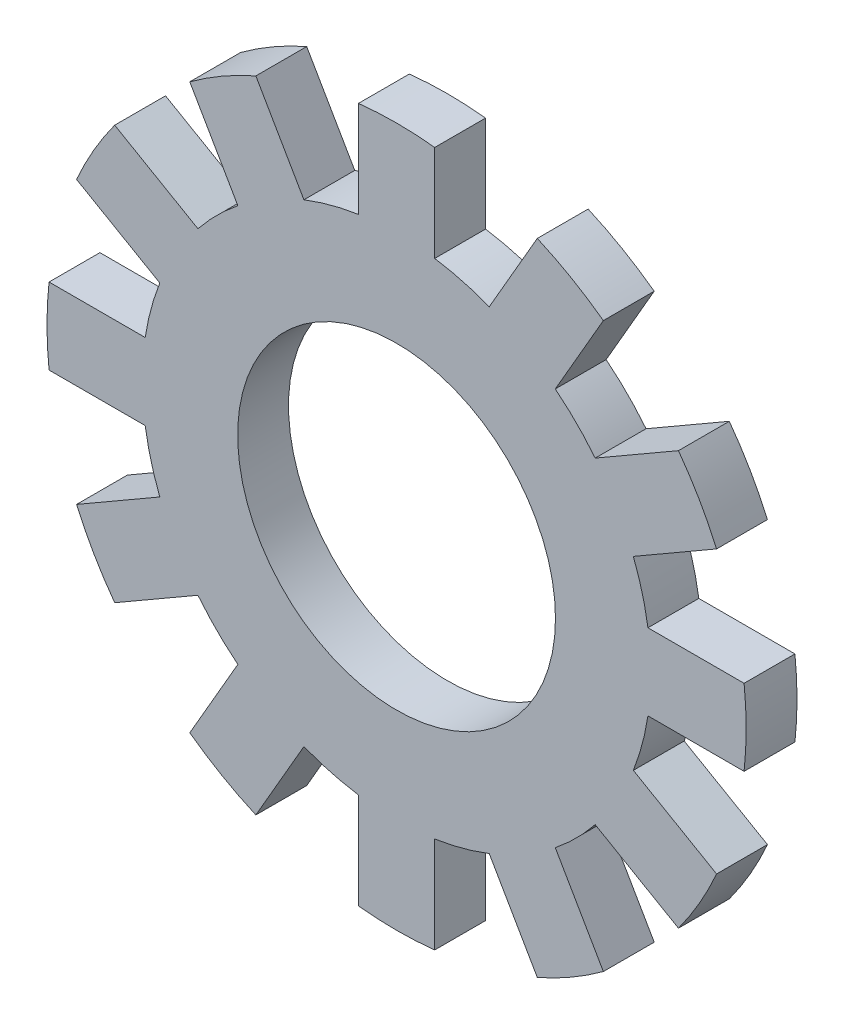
ISO-10303-21;
HEADER;
FILE_DESCRIPTION(('STEP AP214'),'2;1');
FILE_NAME('part.step','',(''),(''),'','','');
FILE_SCHEMA(('AUTOMOTIVE_DESIGN { 1 0 10303 214 1 1 1 1 }'));
ENDSEC;
DATA;
#1=APPLICATION_CONTEXT('core data for automotive mechanical design processes');
#2=APPLICATION_PROTOCOL_DEFINITION('international standard','automotive_design',2000,#1);
#3=PRODUCT_CONTEXT('',#1,'mechanical');
#4=PRODUCT('Part','Part','',(#3));
#5=PRODUCT_RELATED_PRODUCT_CATEGORY('part','',(#4));
#6=PRODUCT_DEFINITION_FORMATION('','',#4);
#7=PRODUCT_DEFINITION_CONTEXT('part definition',#1,'design');
#8=PRODUCT_DEFINITION('design','',#6,#7);
#9=PRODUCT_DEFINITION_SHAPE('','',#8);
#10=(LENGTH_UNIT() NAMED_UNIT(*) SI_UNIT(.MILLI.,.METRE.));
#11=(NAMED_UNIT(*) PLANE_ANGLE_UNIT() SI_UNIT($,.RADIAN.));
#12=(NAMED_UNIT(*) SI_UNIT($,.STERADIAN.) SOLID_ANGLE_UNIT());
#13=UNCERTAINTY_MEASURE_WITH_UNIT(LENGTH_MEASURE(1.E-05),#10,'distance_accuracy_value','');
#14=(GEOMETRIC_REPRESENTATION_CONTEXT(3) GLOBAL_UNCERTAINTY_ASSIGNED_CONTEXT((#13)) GLOBAL_UNIT_ASSIGNED_CONTEXT((#10,
#11,#12)) REPRESENTATION_CONTEXT('',''));
#15=CARTESIAN_POINT('',(0.,0.,0.));
#16=DIRECTION('',(0.,0.,1.));
#17=DIRECTION('',(1.,0.,0.));
#18=AXIS2_PLACEMENT_3D('',#15,#16,#17);
#19=CARTESIAN_POINT('',(0.,0.,0.2));
#20=DIRECTION('',(0.,0.,-1.));
#21=DIRECTION('',(-1.,0.,0.));
#22=AXIS2_PLACEMENT_3D('',#19,#20,#21);
#23=CYLINDRICAL_SURFACE('',#22,2.);
#24=CARTESIAN_POINT('',(0.,0.,-0.2));
#25=DIRECTION('',(0.,0.,1.));
#26=DIRECTION('',(1.,0.,0.));
#27=AXIS2_PLACEMENT_3D('',#24,#25,#26);
#28=CIRCLE('',#27,2.);
#29=CARTESIAN_POINT('',(1.56245437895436,1.24849361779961,-0.2));
#30=VERTEX_POINT('',#29);
#31=CARTESIAN_POINT('',(1.24849361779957,1.56245437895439,-0.2));
#32=VERTEX_POINT('',#31);
#33=EDGE_CURVE('E361',#30,#32,#28,.T.);
#34=ORIENTED_EDGE('',*,*,#33,.T.);
#35=DIRECTION('',(0.,0.,-1.));
#36=VECTOR('',#35,1.);
#37=CARTESIAN_POINT('',(1.24849361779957,1.56245437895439,0.2));
#38=LINE('',#37,#36);
#39=CARTESIAN_POINT('',(1.24849361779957,1.56245437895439,0.2));
#40=VERTEX_POINT('',#39);
#41=EDGE_CURVE('E352',#40,#32,#38,.T.);
#42=ORIENTED_EDGE('',*,*,#41,.F.);
#43=CARTESIAN_POINT('',(0.,0.,0.2));
#44=DIRECTION('',(0.,0.,1.));
#45=DIRECTION('',(1.,0.,0.));
#46=AXIS2_PLACEMENT_3D('',#43,#44,#45);
#47=CIRCLE('',#46,2.);
#48=CARTESIAN_POINT('',(1.56245437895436,1.24849361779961,0.2));
#49=VERTEX_POINT('',#48);
#50=EDGE_CURVE('E64',#49,#40,#47,.T.);
#51=ORIENTED_EDGE('',*,*,#50,.F.);
#52=DIRECTION('',(0.,0.,-1.));
#53=VECTOR('',#52,1.);
#54=CARTESIAN_POINT('',(1.56245437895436,1.24849361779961,0.2));
#55=LINE('',#54,#53);
#56=EDGE_CURVE('E628',#49,#30,#55,.T.);
#57=ORIENTED_EDGE('',*,*,#56,.T.);
#58=EDGE_LOOP('',(#34,#42,#51,#57));
#59=FACE_BOUND('',#58,.T.);
#60=ADVANCED_FACE('F39',(#59),#23,.T.);
#61=DIRECTION('',(0.,0.,-1.));
#62=VECTOR('',#61,1.);
#63=CARTESIAN_POINT('',(0.728878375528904,1.86245437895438,0.2));
#64=LINE('',#63,#62);
#65=CARTESIAN_POINT('',(0.728878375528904,1.86245437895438,0.2));
#66=VERTEX_POINT('',#65);
#67=CARTESIAN_POINT('',(0.728878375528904,1.86245437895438,-0.2));
#68=VERTEX_POINT('',#67);
#69=EDGE_CURVE('E647',#66,#68,#64,.T.);
#70=ORIENTED_EDGE('',*,*,#69,.T.);
#71=CARTESIAN_POINT('',(0.3,1.97737199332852,-0.2));
#72=VERTEX_POINT('',#71);
#73=EDGE_CURVE('E388',#68,#72,#28,.T.);
#74=ORIENTED_EDGE('',*,*,#73,.T.);
#75=DIRECTION('',(0.,0.,-1.));
#76=VECTOR('',#75,1.);
#77=CARTESIAN_POINT('',(0.3,1.97737199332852,0.2));
#78=LINE('',#77,#76);
#79=CARTESIAN_POINT('',(0.3,1.97737199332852,0.2));
#80=VERTEX_POINT('',#79);
#81=EDGE_CURVE('E405',#80,#72,#78,.T.);
#82=ORIENTED_EDGE('',*,*,#81,.F.);
#83=EDGE_CURVE('E50',#66,#80,#47,.T.);
#84=ORIENTED_EDGE('',*,*,#83,.F.);
#85=EDGE_LOOP('',(#70,#74,#82,#84));
#86=FACE_BOUND('',#85,.T.);
#87=ADVANCED_FACE('F816',(#86),#23,.T.);
#88=CARTESIAN_POINT('',(1.97737199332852,0.300000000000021,-0.2));
#89=VERTEX_POINT('',#88);
#90=CARTESIAN_POINT('',(1.86245437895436,0.72887837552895,-0.2));
#91=VERTEX_POINT('',#90);
#92=EDGE_CURVE('E905',#89,#91,#28,.T.);
#93=ORIENTED_EDGE('',*,*,#92,.T.);
#94=DIRECTION('',(0.,0.,-1.));
#95=VECTOR('',#94,1.);
#96=CARTESIAN_POINT('',(1.86245437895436,0.72887837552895,0.2));
#97=LINE('',#96,#95);
#98=CARTESIAN_POINT('',(1.86245437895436,0.72887837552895,0.2));
#99=VERTEX_POINT('',#98);
#100=EDGE_CURVE('E785',#99,#91,#97,.T.);
#101=ORIENTED_EDGE('',*,*,#100,.F.);
#102=CARTESIAN_POINT('',(1.97737199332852,0.300000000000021,0.2));
#103=VERTEX_POINT('',#102);
#104=EDGE_CURVE('E371',#103,#99,#47,.T.);
#105=ORIENTED_EDGE('',*,*,#104,.F.);
#106=DIRECTION('',(0.,0.,-1.));
#107=VECTOR('',#106,1.);
#108=CARTESIAN_POINT('',(1.97737199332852,0.300000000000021,0.2));
#109=LINE('',#108,#107);
#110=EDGE_CURVE('E606',#103,#89,#109,.T.);
#111=ORIENTED_EDGE('',*,*,#110,.T.);
#112=EDGE_LOOP('',(#93,#101,#105,#111));
#113=FACE_BOUND('',#112,.T.);
#114=ADVANCED_FACE('F903',(#113),#23,.T.);
#115=CARTESIAN_POINT('',(1.86245437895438,-0.728878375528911,-0.2));
#116=VERTEX_POINT('',#115);
#117=CARTESIAN_POINT('',(1.97737199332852,-0.299999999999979,-0.2));
#118=VERTEX_POINT('',#117);
#119=EDGE_CURVE('E886',#116,#118,#28,.T.);
#120=ORIENTED_EDGE('',*,*,#119,.T.);
#121=DIRECTION('',(0.,0.,-1.));
#122=VECTOR('',#121,1.);
#123=CARTESIAN_POINT('',(1.97737199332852,-0.299999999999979,0.2));
#124=LINE('',#123,#122);
#125=CARTESIAN_POINT('',(1.97737199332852,-0.299999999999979,0.2));
#126=VERTEX_POINT('',#125);
#127=EDGE_CURVE('E771',#126,#118,#124,.T.);
#128=ORIENTED_EDGE('',*,*,#127,.F.);
#129=CARTESIAN_POINT('',(1.86245437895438,-0.728878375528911,0.2));
#130=VERTEX_POINT('',#129);
#131=EDGE_CURVE('E376',#130,#126,#47,.T.);
#132=ORIENTED_EDGE('',*,*,#131,.F.);
#133=DIRECTION('',(0.,0.,-1.));
#134=VECTOR('',#133,1.);
#135=CARTESIAN_POINT('',(1.86245437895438,-0.728878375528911,0.2));
#136=LINE('',#135,#134);
#137=EDGE_CURVE('E584',#130,#116,#136,.T.);
#138=ORIENTED_EDGE('',*,*,#137,.T.);
#139=EDGE_LOOP('',(#120,#128,#132,#138));
#140=FACE_BOUND('',#139,.T.);
#141=ADVANCED_FACE('F885',(#140),#23,.T.);
#142=CARTESIAN_POINT('',(1.2484936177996,-1.56245437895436,-0.2));
#143=VERTEX_POINT('',#142);
#144=CARTESIAN_POINT('',(1.56245437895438,-1.24849361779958,-0.2));
#145=VERTEX_POINT('',#144);
#146=EDGE_CURVE('E966',#143,#145,#28,.T.);
#147=ORIENTED_EDGE('',*,*,#146,.T.);
#148=DIRECTION('',(0.,0.,-1.));
#149=VECTOR('',#148,1.);
#150=CARTESIAN_POINT('',(1.56245437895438,-1.24849361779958,0.2));
#151=LINE('',#150,#149);
#152=CARTESIAN_POINT('',(1.56245437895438,-1.24849361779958,0.2));
#153=VERTEX_POINT('',#152);
#154=EDGE_CURVE('E758',#153,#145,#151,.T.);
#155=ORIENTED_EDGE('',*,*,#154,.F.);
#156=CARTESIAN_POINT('',(1.2484936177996,-1.56245437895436,0.2));
#157=VERTEX_POINT('',#156);
#158=EDGE_CURVE('E872',#157,#153,#47,.T.);
#159=ORIENTED_EDGE('',*,*,#158,.F.);
#160=DIRECTION('',(0.,0.,-1.));
#161=VECTOR('',#160,1.);
#162=CARTESIAN_POINT('',(1.2484936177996,-1.56245437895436,0.2));
#163=LINE('',#162,#161);
#164=EDGE_CURVE('E562',#157,#143,#163,.T.);
#165=ORIENTED_EDGE('',*,*,#164,.T.);
#166=EDGE_LOOP('',(#147,#155,#159,#165));
#167=FACE_BOUND('',#166,.T.);
#168=ADVANCED_FACE('F974',(#167),#23,.T.);
#169=CARTESIAN_POINT('',(0.3,-1.97737199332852,-0.2));
#170=VERTEX_POINT('',#169);
#171=CARTESIAN_POINT('',(0.728878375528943,-1.86245437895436,-0.2));
#172=VERTEX_POINT('',#171);
#173=EDGE_CURVE('E961',#170,#172,#28,.T.);
#174=ORIENTED_EDGE('',*,*,#173,.T.);
#175=DIRECTION('',(0.,0.,-1.));
#176=VECTOR('',#175,1.);
#177=CARTESIAN_POINT('',(0.728878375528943,-1.86245437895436,0.2));
#178=LINE('',#177,#176);
#179=CARTESIAN_POINT('',(0.728878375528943,-1.86245437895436,0.2));
#180=VERTEX_POINT('',#179);
#181=EDGE_CURVE('E745',#180,#172,#178,.T.);
#182=ORIENTED_EDGE('',*,*,#181,.F.);
#183=CARTESIAN_POINT('',(0.3,-1.97737199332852,0.2));
#184=VERTEX_POINT('',#183);
#185=EDGE_CURVE('E867',#184,#180,#47,.T.);
#186=ORIENTED_EDGE('',*,*,#185,.F.);
#187=DIRECTION('',(0.,0.,-1.));
#188=VECTOR('',#187,1.);
#189=CARTESIAN_POINT('',(0.3,-1.97737199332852,0.2));
#190=LINE('',#189,#188);
#191=EDGE_CURVE('E540',#184,#170,#190,.T.);
#192=ORIENTED_EDGE('',*,*,#191,.T.);
#193=EDGE_LOOP('',(#174,#182,#186,#192));
#194=FACE_BOUND('',#193,.T.);
#195=ADVANCED_FACE('F1402',(#194),#23,.T.);
#196=CARTESIAN_POINT('',(-0.728878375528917,-1.86245437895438,-0.2));
#197=VERTEX_POINT('',#196);
#198=CARTESIAN_POINT('',(-0.3,-1.97737199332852,-0.2));
#199=VERTEX_POINT('',#198);
#200=EDGE_CURVE('E957',#197,#199,#28,.T.);
#201=ORIENTED_EDGE('',*,*,#200,.T.);
#202=DIRECTION('',(0.,0.,-1.));
#203=VECTOR('',#202,1.);
#204=CARTESIAN_POINT('',(-0.3,-1.97737199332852,0.2));
#205=LINE('',#204,#203);
#206=CARTESIAN_POINT('',(-0.3,-1.97737199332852,0.2));
#207=VERTEX_POINT('',#206);
#208=EDGE_CURVE('E731',#207,#199,#205,.T.);
#209=ORIENTED_EDGE('',*,*,#208,.F.);
#210=CARTESIAN_POINT('',(-0.728878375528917,-1.86245437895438,0.2));
#211=VERTEX_POINT('',#210);
#212=EDGE_CURVE('E862',#211,#207,#47,.T.);
#213=ORIENTED_EDGE('',*,*,#212,.F.);
#214=DIRECTION('',(0.,0.,-1.));
#215=VECTOR('',#214,1.);
#216=CARTESIAN_POINT('',(-0.728878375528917,-1.86245437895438,0.2));
#217=LINE('',#216,#215);
#218=EDGE_CURVE('E518',#211,#197,#217,.T.);
#219=ORIENTED_EDGE('',*,*,#218,.T.);
#220=EDGE_LOOP('',(#201,#209,#213,#219));
#221=FACE_BOUND('',#220,.T.);
#222=ADVANCED_FACE('F1394',(#221),#23,.T.);
#223=CARTESIAN_POINT('',(-1.56245437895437,-1.2484936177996,-0.2));
#224=VERTEX_POINT('',#223);
#225=CARTESIAN_POINT('',(-1.24849361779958,-1.56245437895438,-0.2));
#226=VERTEX_POINT('',#225);
#227=EDGE_CURVE('E952',#224,#226,#28,.T.);
#228=ORIENTED_EDGE('',*,*,#227,.T.);
#229=DIRECTION('',(0.,0.,-1.));
#230=VECTOR('',#229,1.);
#231=CARTESIAN_POINT('',(-1.24849361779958,-1.56245437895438,0.2));
#232=LINE('',#231,#230);
#233=CARTESIAN_POINT('',(-1.24849361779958,-1.56245437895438,0.2));
#234=VERTEX_POINT('',#233);
#235=EDGE_CURVE('E717',#234,#226,#232,.T.);
#236=ORIENTED_EDGE('',*,*,#235,.F.);
#237=CARTESIAN_POINT('',(-1.56245437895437,-1.2484936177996,0.2));
#238=VERTEX_POINT('',#237);
#239=EDGE_CURVE('E858',#238,#234,#47,.T.);
#240=ORIENTED_EDGE('',*,*,#239,.F.);
#241=DIRECTION('',(0.,0.,-1.));
#242=VECTOR('',#241,1.);
#243=CARTESIAN_POINT('',(-1.56245437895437,-1.2484936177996,0.2));
#244=LINE('',#243,#242);
#245=EDGE_CURVE('E496',#238,#224,#244,.T.);
#246=ORIENTED_EDGE('',*,*,#245,.T.);
#247=EDGE_LOOP('',(#228,#236,#240,#246));
#248=FACE_BOUND('',#247,.T.);
#249=ADVANCED_FACE('F1386',(#248),#23,.T.);
#250=CARTESIAN_POINT('',(-1.97737199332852,-0.300000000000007,-0.2));
#251=VERTEX_POINT('',#250);
#252=CARTESIAN_POINT('',(-1.86245437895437,-0.728878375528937,-0.2));
#253=VERTEX_POINT('',#252);
#254=EDGE_CURVE('E947',#251,#253,#28,.T.);
#255=ORIENTED_EDGE('',*,*,#254,.T.);
#256=DIRECTION('',(0.,0.,-1.));
#257=VECTOR('',#256,1.);
#258=CARTESIAN_POINT('',(-1.86245437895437,-0.728878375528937,0.2));
#259=LINE('',#258,#257);
#260=CARTESIAN_POINT('',(-1.86245437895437,-0.728878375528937,0.2));
#261=VERTEX_POINT('',#260);
#262=EDGE_CURVE('E703',#261,#253,#259,.T.);
#263=ORIENTED_EDGE('',*,*,#262,.F.);
#264=CARTESIAN_POINT('',(-1.97737199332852,-0.300000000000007,0.2));
#265=VERTEX_POINT('',#264);
#266=EDGE_CURVE('E854',#265,#261,#47,.T.);
#267=ORIENTED_EDGE('',*,*,#266,.F.);
#268=DIRECTION('',(0.,0.,-1.));
#269=VECTOR('',#268,1.);
#270=CARTESIAN_POINT('',(-1.97737199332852,-0.300000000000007,0.2));
#271=LINE('',#270,#269);
#272=EDGE_CURVE('E474',#265,#251,#271,.T.);
#273=ORIENTED_EDGE('',*,*,#272,.T.);
#274=EDGE_LOOP('',(#255,#263,#267,#273));
#275=FACE_BOUND('',#274,.T.);
#276=ADVANCED_FACE('F938',(#275),#23,.T.);
#277=CARTESIAN_POINT('',(-1.86245437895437,0.728878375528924,-0.2));
#278=VERTEX_POINT('',#277);
#279=CARTESIAN_POINT('',(-1.97737199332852,0.299999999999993,-0.2));
#280=VERTEX_POINT('',#279);
#281=EDGE_CURVE('E943',#278,#280,#28,.T.);
#282=ORIENTED_EDGE('',*,*,#281,.T.);
#283=DIRECTION('',(0.,0.,-1.));
#284=VECTOR('',#283,1.);
#285=CARTESIAN_POINT('',(-1.97737199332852,0.299999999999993,0.2));
#286=LINE('',#285,#284);
#287=CARTESIAN_POINT('',(-1.97737199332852,0.299999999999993,0.2));
#288=VERTEX_POINT('',#287);
#289=EDGE_CURVE('E689',#288,#280,#286,.T.);
#290=ORIENTED_EDGE('',*,*,#289,.F.);
#291=CARTESIAN_POINT('',(-1.86245437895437,0.728878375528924,0.2));
#292=VERTEX_POINT('',#291);
#293=EDGE_CURVE('E851',#292,#288,#47,.T.);
#294=ORIENTED_EDGE('',*,*,#293,.F.);
#295=DIRECTION('',(0.,0.,-1.));
#296=VECTOR('',#295,1.);
#297=CARTESIAN_POINT('',(-1.86245437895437,0.728878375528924,0.2));
#298=LINE('',#297,#296);
#299=EDGE_CURVE('E452',#292,#278,#298,.T.);
#300=ORIENTED_EDGE('',*,*,#299,.T.);
#301=EDGE_LOOP('',(#282,#290,#294,#300));
#302=FACE_BOUND('',#301,.T.);
#303=ADVANCED_FACE('F934',(#302),#23,.T.);
#304=CARTESIAN_POINT('',(-1.24849361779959,1.56245437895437,-0.2));
#305=VERTEX_POINT('',#304);
#306=CARTESIAN_POINT('',(-1.56245437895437,1.24849361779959,-0.2));
#307=VERTEX_POINT('',#306);
#308=EDGE_CURVE('E941',#305,#307,#28,.T.);
#309=ORIENTED_EDGE('',*,*,#308,.T.);
#310=DIRECTION('',(0.,0.,-1.));
#311=VECTOR('',#310,1.);
#312=CARTESIAN_POINT('',(-1.56245437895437,1.24849361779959,0.2));
#313=LINE('',#312,#311);
#314=CARTESIAN_POINT('',(-1.56245437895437,1.24849361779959,0.2));
#315=VERTEX_POINT('',#314);
#316=EDGE_CURVE('E675',#315,#307,#313,.T.);
#317=ORIENTED_EDGE('',*,*,#316,.F.);
#318=CARTESIAN_POINT('',(-1.24849361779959,1.56245437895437,0.2));
#319=VERTEX_POINT('',#318);
#320=EDGE_CURVE('E49',#319,#315,#47,.T.);
#321=ORIENTED_EDGE('',*,*,#320,.F.);
#322=DIRECTION('',(0.,0.,-1.));
#323=VECTOR('',#322,1.);
#324=CARTESIAN_POINT('',(-1.24849361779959,1.56245437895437,0.2));
#325=LINE('',#324,#323);
#326=EDGE_CURVE('E430',#319,#305,#325,.T.);
#327=ORIENTED_EDGE('',*,*,#326,.T.);
#328=EDGE_LOOP('',(#309,#317,#321,#327));
#329=FACE_BOUND('',#328,.T.);
#330=ADVANCED_FACE('F928',(#329),#23,.T.);
#331=CARTESIAN_POINT('',(-0.3,1.97737199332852,-0.2));
#332=VERTEX_POINT('',#331);
#333=CARTESIAN_POINT('',(-0.72887837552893,1.86245437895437,-0.2));
#334=VERTEX_POINT('',#333);
#335=EDGE_CURVE('E43',#332,#334,#28,.T.);
#336=ORIENTED_EDGE('',*,*,#335,.T.);
#337=DIRECTION('',(0.,0.,-1.));
#338=VECTOR('',#337,1.);
#339=CARTESIAN_POINT('',(-0.72887837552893,1.86245437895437,0.2));
#340=LINE('',#339,#338);
#341=CARTESIAN_POINT('',(-0.72887837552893,1.86245437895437,0.2));
#342=VERTEX_POINT('',#341);
#343=EDGE_CURVE('E659',#342,#334,#340,.T.);
#344=ORIENTED_EDGE('',*,*,#343,.F.);
#345=CARTESIAN_POINT('',(-0.3,1.97737199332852,0.2));
#346=VERTEX_POINT('',#345);
#347=EDGE_CURVE('E11',#346,#342,#47,.T.);
#348=ORIENTED_EDGE('',*,*,#347,.F.);
#349=DIRECTION('',(0.,0.,-1.));
#350=VECTOR('',#349,1.);
#351=CARTESIAN_POINT('',(-0.3,1.97737199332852,0.2));
#352=LINE('',#351,#350);
#353=EDGE_CURVE('E392',#346,#332,#352,.T.);
#354=ORIENTED_EDGE('',*,*,#353,.T.);
#355=EDGE_LOOP('',(#336,#344,#348,#354));
#356=FACE_BOUND('',#355,.T.);
#357=ADVANCED_FACE('F41',(#356),#23,.T.);
#358=CARTESIAN_POINT('',(0.,0.,0.2));
#359=DIRECTION('',(0.,0.,1.));
#360=DIRECTION('',(1.,0.,0.));
#361=AXIS2_PLACEMENT_3D('',#358,#359,#360);
#362=PLANE('',#361);
#363=ORIENTED_EDGE('',*,*,#347,.T.);
#364=DIRECTION('',(0.500000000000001,-0.866025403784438,0.));
#365=VECTOR('',#364,1.);
#366=CARTESIAN_POINT('',(-1.10698607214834,2.51735612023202,0.2));
#367=LINE('',#366,#365);
#368=CARTESIAN_POINT('',(-1.10698607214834,2.51735612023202,0.2));
#369=VERTEX_POINT('',#368);
#370=EDGE_CURVE('E670',#369,#342,#367,.T.);
#371=ORIENTED_EDGE('',*,*,#370,.F.);
#372=CARTESIAN_POINT('',(0.,0.,0.2));
#373=DIRECTION('',(0.,0.,1.));
#374=DIRECTION('',(0.866025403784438,0.500000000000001,0.));
#375=AXIS2_PLACEMENT_3D('',#372,#373,#374);
#376=CIRCLE('',#375,2.75);
#377=CARTESIAN_POINT('',(-1.626601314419,2.21735612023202,0.2));
#378=VERTEX_POINT('',#377);
#379=EDGE_CURVE('E439',#369,#378,#376,.T.);
#380=ORIENTED_EDGE('',*,*,#379,.T.);
#381=DIRECTION('',(0.500000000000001,-0.866025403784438,0.));
#382=VECTOR('',#381,1.);
#383=CARTESIAN_POINT('',(-1.626601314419,2.21735612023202,0.2));
#384=LINE('',#383,#382);
#385=EDGE_CURVE('E434',#378,#319,#384,.T.);
#386=ORIENTED_EDGE('',*,*,#385,.T.);
#387=ORIENTED_EDGE('',*,*,#320,.T.);
#388=DIRECTION('',(0.86602540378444,-0.499999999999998,0.));
#389=VECTOR('',#388,1.);
#390=CARTESIAN_POINT('',(-2.21735612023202,1.62660131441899,0.2));
#391=LINE('',#390,#389);
#392=CARTESIAN_POINT('',(-2.21735612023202,1.62660131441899,0.2));
#393=VERTEX_POINT('',#392);
#394=EDGE_CURVE('E684',#393,#315,#391,.T.);
#395=ORIENTED_EDGE('',*,*,#394,.F.);
#396=CARTESIAN_POINT('',(0.,0.,0.2));
#397=DIRECTION('',(0.,0.,1.));
#398=DIRECTION('',(0.499999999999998,0.86602540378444,0.));
#399=AXIS2_PLACEMENT_3D('',#396,#397,#398);
#400=CIRCLE('',#399,2.75);
#401=CARTESIAN_POINT('',(-2.51735612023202,1.10698607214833,0.2));
#402=VERTEX_POINT('',#401);
#403=EDGE_CURVE('E461',#393,#402,#400,.T.);
#404=ORIENTED_EDGE('',*,*,#403,.T.);
#405=DIRECTION('',(0.86602540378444,-0.499999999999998,0.));
#406=VECTOR('',#405,1.);
#407=CARTESIAN_POINT('',(-2.51735612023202,1.10698607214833,0.2));
#408=LINE('',#407,#406);
#409=EDGE_CURVE('E456',#402,#292,#408,.T.);
#410=ORIENTED_EDGE('',*,*,#409,.T.);
#411=ORIENTED_EDGE('',*,*,#293,.T.);
#412=DIRECTION('',(1.,0.,0.));
#413=VECTOR('',#412,1.);
#414=CARTESIAN_POINT('',(-2.73358738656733,0.29999999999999,0.2));
#415=LINE('',#414,#413);
#416=CARTESIAN_POINT('',(-2.73358738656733,0.299999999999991,0.2));
#417=VERTEX_POINT('',#416);
#418=EDGE_CURVE('E698',#417,#288,#415,.T.);
#419=ORIENTED_EDGE('',*,*,#418,.F.);
#420=CARTESIAN_POINT('',(0.,0.,0.2));
#421=DIRECTION('',(0.,0.,1.));
#422=DIRECTION('',(0.,1.,0.));
#423=AXIS2_PLACEMENT_3D('',#420,#421,#422);
#424=CIRCLE('',#423,2.75);
#425=CARTESIAN_POINT('',(-2.73358738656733,-0.30000000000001,0.2));
#426=VERTEX_POINT('',#425);
#427=EDGE_CURVE('E483',#417,#426,#424,.T.);
#428=ORIENTED_EDGE('',*,*,#427,.T.);
#429=DIRECTION('',(1.,0.,0.));
#430=VECTOR('',#429,1.);
#431=CARTESIAN_POINT('',(-2.73358738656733,-0.30000000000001,0.2));
#432=LINE('',#431,#430);
#433=EDGE_CURVE('E478',#426,#265,#432,.T.);
#434=ORIENTED_EDGE('',*,*,#433,.T.);
#435=ORIENTED_EDGE('',*,*,#266,.T.);
#436=DIRECTION('',(0.866025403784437,0.500000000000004,0.));
#437=VECTOR('',#436,1.);
#438=CARTESIAN_POINT('',(-2.51735612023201,-1.10698607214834,0.2));
#439=LINE('',#438,#437);
#440=CARTESIAN_POINT('',(-2.51735612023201,-1.10698607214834,0.2));
#441=VERTEX_POINT('',#440);
#442=EDGE_CURVE('E712',#441,#261,#439,.T.);
#443=ORIENTED_EDGE('',*,*,#442,.F.);
#444=CARTESIAN_POINT('',(0.,0.,0.2));
#445=DIRECTION('',(0.,0.,1.));
#446=DIRECTION('',(-0.500000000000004,0.866025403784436,0.));
#447=AXIS2_PLACEMENT_3D('',#444,#445,#446);
#448=CIRCLE('',#447,2.75);
#449=CARTESIAN_POINT('',(-2.21735612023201,-1.62660131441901,0.2));
#450=VERTEX_POINT('',#449);
#451=EDGE_CURVE('E505',#441,#450,#448,.T.);
#452=ORIENTED_EDGE('',*,*,#451,.T.);
#453=DIRECTION('',(0.866025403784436,0.500000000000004,0.));
#454=VECTOR('',#453,1.);
#455=CARTESIAN_POINT('',(-2.21735612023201,-1.62660131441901,0.2));
#456=LINE('',#455,#454);
#457=EDGE_CURVE('E500',#450,#238,#456,.T.);
#458=ORIENTED_EDGE('',*,*,#457,.T.);
#459=ORIENTED_EDGE('',*,*,#239,.T.);
#460=DIRECTION('',(0.499999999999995,0.866025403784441,0.));
#461=VECTOR('',#460,1.);
#462=CARTESIAN_POINT('',(-1.62660131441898,-2.21735612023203,0.2));
#463=LINE('',#462,#461);
#464=CARTESIAN_POINT('',(-1.62660131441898,-2.21735612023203,0.2));
#465=VERTEX_POINT('',#464);
#466=EDGE_CURVE('E726',#465,#234,#463,.T.);
#467=ORIENTED_EDGE('',*,*,#466,.F.);
#468=CARTESIAN_POINT('',(0.,0.,0.2));
#469=DIRECTION('',(0.,0.,1.));
#470=DIRECTION('',(-0.866025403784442,0.499999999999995,0.));
#471=AXIS2_PLACEMENT_3D('',#468,#469,#470);
#472=CIRCLE('',#471,2.75);
#473=CARTESIAN_POINT('',(-1.10698607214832,-2.51735612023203,0.2));
#474=VERTEX_POINT('',#473);
#475=EDGE_CURVE('E527',#465,#474,#472,.T.);
#476=ORIENTED_EDGE('',*,*,#475,.T.);
#477=DIRECTION('',(0.499999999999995,0.866025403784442,0.));
#478=VECTOR('',#477,1.);
#479=CARTESIAN_POINT('',(-1.10698607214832,-2.51735612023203,0.2));
#480=LINE('',#479,#478);
#481=EDGE_CURVE('E522',#474,#211,#480,.T.);
#482=ORIENTED_EDGE('',*,*,#481,.T.);
#483=ORIENTED_EDGE('',*,*,#212,.T.);
#484=DIRECTION('',(0.,1.,0.));
#485=VECTOR('',#484,1.);
#486=CARTESIAN_POINT('',(-0.3,-2.73358738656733,0.2));
#487=LINE('',#486,#485);
#488=CARTESIAN_POINT('',(-0.3,-2.73358738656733,0.2));
#489=VERTEX_POINT('',#488);
#490=EDGE_CURVE('E740',#489,#207,#487,.T.);
#491=ORIENTED_EDGE('',*,*,#490,.F.);
#492=CARTESIAN_POINT('',(0.,0.,0.2));
#493=DIRECTION('',(0.,0.,1.));
#494=DIRECTION('',(-1.,0.,0.));
#495=AXIS2_PLACEMENT_3D('',#492,#493,#494);
#496=CIRCLE('',#495,2.75);
#497=CARTESIAN_POINT('',(0.3,-2.73358738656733,0.2));
#498=VERTEX_POINT('',#497);
#499=EDGE_CURVE('E549',#489,#498,#496,.T.);
#500=ORIENTED_EDGE('',*,*,#499,.T.);
#501=DIRECTION('',(0.,1.,0.));
#502=VECTOR('',#501,1.);
#503=CARTESIAN_POINT('',(0.3,-2.73358738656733,0.2));
#504=LINE('',#503,#502);
#505=EDGE_CURVE('E544',#498,#184,#504,.T.);
#506=ORIENTED_EDGE('',*,*,#505,.T.);
#507=ORIENTED_EDGE('',*,*,#185,.T.);
#508=DIRECTION('',(-0.500000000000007,0.866025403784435,0.));
#509=VECTOR('',#508,1.);
#510=CARTESIAN_POINT('',(1.10698607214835,-2.51735612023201,0.2));
#511=LINE('',#510,#509);
#512=CARTESIAN_POINT('',(1.10698607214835,-2.51735612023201,0.2));
#513=VERTEX_POINT('',#512);
#514=EDGE_CURVE('E753',#513,#180,#511,.T.);
#515=ORIENTED_EDGE('',*,*,#514,.F.);
#516=CARTESIAN_POINT('',(0.,0.,0.2));
#517=DIRECTION('',(0.,0.,1.));
#518=DIRECTION('',(-0.866025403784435,-0.500000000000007,0.));
#519=AXIS2_PLACEMENT_3D('',#516,#517,#518);
#520=CIRCLE('',#519,2.75);
#521=CARTESIAN_POINT('',(1.62660131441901,-2.21735612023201,0.2));
#522=VERTEX_POINT('',#521);
#523=EDGE_CURVE('E571',#513,#522,#520,.T.);
#524=ORIENTED_EDGE('',*,*,#523,.T.);
#525=DIRECTION('',(-0.500000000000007,0.866025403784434,0.));
#526=VECTOR('',#525,1.);
#527=CARTESIAN_POINT('',(1.62660131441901,-2.21735612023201,0.2));
#528=LINE('',#527,#526);
#529=EDGE_CURVE('E566',#522,#157,#528,.T.);
#530=ORIENTED_EDGE('',*,*,#529,.T.);
#531=ORIENTED_EDGE('',*,*,#158,.T.);
#532=DIRECTION('',(-0.866025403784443,0.499999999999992,0.));
#533=VECTOR('',#532,1.);
#534=CARTESIAN_POINT('',(2.21735612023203,-1.62660131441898,0.2));
#535=LINE('',#534,#533);
#536=CARTESIAN_POINT('',(2.21735612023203,-1.62660131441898,0.2));
#537=VERTEX_POINT('',#536);
#538=EDGE_CURVE('E766',#537,#153,#535,.T.);
#539=ORIENTED_EDGE('',*,*,#538,.F.);
#540=CARTESIAN_POINT('',(0.,0.,0.2));
#541=DIRECTION('',(0.,0.,1.));
#542=DIRECTION('',(-0.499999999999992,-0.866025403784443,0.));
#543=AXIS2_PLACEMENT_3D('',#540,#541,#542);
#544=CIRCLE('',#543,2.75);
#545=CARTESIAN_POINT('',(2.51735612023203,-1.10698607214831,0.2));
#546=VERTEX_POINT('',#545);
#547=EDGE_CURVE('E593',#537,#546,#544,.T.);
#548=ORIENTED_EDGE('',*,*,#547,.T.);
#549=DIRECTION('',(-0.866025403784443,0.499999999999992,0.));
#550=VECTOR('',#549,1.);
#551=CARTESIAN_POINT('',(2.51735612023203,-1.10698607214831,0.2));
#552=LINE('',#551,#550);
#553=EDGE_CURVE('E588',#546,#130,#552,.T.);
#554=ORIENTED_EDGE('',*,*,#553,.T.);
#555=ORIENTED_EDGE('',*,*,#131,.T.);
#556=DIRECTION('',(-1.,0.,0.));
#557=VECTOR('',#556,1.);
#558=CARTESIAN_POINT('',(2.73358738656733,-0.299999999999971,0.2));
#559=LINE('',#558,#557);
#560=CARTESIAN_POINT('',(2.73358738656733,-0.299999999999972,0.2));
#561=VERTEX_POINT('',#560);
#562=EDGE_CURVE('E780',#561,#126,#559,.T.);
#563=ORIENTED_EDGE('',*,*,#562,.F.);
#564=CARTESIAN_POINT('',(0.,0.,0.2));
#565=DIRECTION('',(0.,0.,1.));
#566=DIRECTION('',(0.,-1.,0.));
#567=AXIS2_PLACEMENT_3D('',#564,#565,#566);
#568=CIRCLE('',#567,2.75);
#569=CARTESIAN_POINT('',(2.73358738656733,0.300000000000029,0.2));
#570=VERTEX_POINT('',#569);
#571=EDGE_CURVE('E615',#561,#570,#568,.T.);
#572=ORIENTED_EDGE('',*,*,#571,.T.);
#573=DIRECTION('',(-1.,0.,0.));
#574=VECTOR('',#573,1.);
#575=CARTESIAN_POINT('',(2.73358738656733,0.300000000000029,0.2));
#576=LINE('',#575,#574);
#577=EDGE_CURVE('E610',#570,#103,#576,.T.);
#578=ORIENTED_EDGE('',*,*,#577,.T.);
#579=ORIENTED_EDGE('',*,*,#104,.T.);
#580=DIRECTION('',(-0.866025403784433,-0.50000000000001,0.));
#581=VECTOR('',#580,1.);
#582=CARTESIAN_POINT('',(2.51735612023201,1.10698607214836,0.2));
#583=LINE('',#582,#581);
#584=CARTESIAN_POINT('',(2.51735612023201,1.10698607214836,0.2));
#585=VERTEX_POINT('',#584);
#586=EDGE_CURVE('E794',#585,#99,#583,.T.);
#587=ORIENTED_EDGE('',*,*,#586,.F.);
#588=CARTESIAN_POINT('',(0.,0.,0.2));
#589=DIRECTION('',(0.,0.,1.));
#590=DIRECTION('',(0.50000000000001,-0.866025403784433,0.));
#591=AXIS2_PLACEMENT_3D('',#588,#589,#590);
#592=CIRCLE('',#591,2.75);
#593=CARTESIAN_POINT('',(2.217356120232,1.62660131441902,0.2));
#594=VERTEX_POINT('',#593);
#595=EDGE_CURVE('E635',#585,#594,#592,.T.);
#596=ORIENTED_EDGE('',*,*,#595,.T.);
#597=DIRECTION('',(-0.866025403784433,-0.50000000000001,0.));
#598=VECTOR('',#597,1.);
#599=CARTESIAN_POINT('',(2.217356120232,1.62660131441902,0.2));
#600=LINE('',#599,#598);
#601=EDGE_CURVE('E368',#594,#49,#600,.T.);
#602=ORIENTED_EDGE('',*,*,#601,.T.);
#603=ORIENTED_EDGE('',*,*,#50,.T.);
#604=DIRECTION('',(-0.499999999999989,-0.866025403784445,0.));
#605=VECTOR('',#604,1.);
#606=CARTESIAN_POINT('',(1.62660131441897,2.21735612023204,0.2));
#607=LINE('',#606,#605);
#608=CARTESIAN_POINT('',(1.62660131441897,2.21735612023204,0.2));
#609=VERTEX_POINT('',#608);
#610=EDGE_CURVE('E349',#609,#40,#607,.T.);
#611=ORIENTED_EDGE('',*,*,#610,.F.);
#612=CARTESIAN_POINT('',(0.,0.,0.2));
#613=DIRECTION('',(0.,0.,1.));
#614=DIRECTION('',(0.866025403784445,-0.499999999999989,0.));
#615=AXIS2_PLACEMENT_3D('',#612,#613,#614);
#616=CIRCLE('',#615,2.75);
#617=CARTESIAN_POINT('',(1.1069860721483,2.51735612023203,0.2));
#618=VERTEX_POINT('',#617);
#619=EDGE_CURVE('E655',#609,#618,#616,.T.);
#620=ORIENTED_EDGE('',*,*,#619,.T.);
#621=DIRECTION('',(-0.499999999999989,-0.866025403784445,0.));
#622=VECTOR('',#621,1.);
#623=CARTESIAN_POINT('',(1.1069860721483,2.51735612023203,0.2));
#624=LINE('',#623,#622);
#625=EDGE_CURVE('E650',#618,#66,#624,.T.);
#626=ORIENTED_EDGE('',*,*,#625,.T.);
#627=ORIENTED_EDGE('',*,*,#83,.T.);
#628=DIRECTION('',(0.,-1.,0.));
#629=VECTOR('',#628,1.);
#630=CARTESIAN_POINT('',(0.3,2.73358738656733,0.2));
#631=LINE('',#630,#629);
#632=CARTESIAN_POINT('',(0.3,2.73358738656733,0.2));
#633=VERTEX_POINT('',#632);
#634=EDGE_CURVE('E418',#633,#80,#631,.T.);
#635=ORIENTED_EDGE('',*,*,#634,.F.);
#636=CARTESIAN_POINT('',(0.,0.,0.2));
#637=DIRECTION('',(0.,0.,1.));
#638=DIRECTION('',(1.,0.,0.));
#639=AXIS2_PLACEMENT_3D('',#636,#637,#638);
#640=CIRCLE('',#639,2.75);
#641=CARTESIAN_POINT('',(-0.3,2.73358738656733,0.2));
#642=VERTEX_POINT('',#641);
#643=EDGE_CURVE('E401',#633,#642,#640,.T.);
#644=ORIENTED_EDGE('',*,*,#643,.T.);
#645=DIRECTION('',(0.,-1.,0.));
#646=VECTOR('',#645,1.);
#647=CARTESIAN_POINT('',(-0.3,2.73358738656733,0.2));
#648=LINE('',#647,#646);
#649=EDGE_CURVE('E396',#642,#346,#648,.T.);
#650=ORIENTED_EDGE('',*,*,#649,.T.);
#651=EDGE_LOOP('',(#363,#371,#380,#386,#387,#395,#404,#410,#411,#419,#428,#434,#435,#443,#452,
#458,#459,#467,#476,#482,#483,#491,#500,#506,#507,#515,#524,#530,#531,#539,#548,#554,#555,#563,
#572,#578,#579,#587,#596,#602,#603,#611,#620,#626,#627,#635,#644,#650));
#652=FACE_BOUND('',#651,.T.);
#653=CARTESIAN_POINT('',(0.,0.,0.2));
#654=DIRECTION('',(0.,0.,1.));
#655=DIRECTION('',(1.,0.,0.));
#656=AXIS2_PLACEMENT_3D('',#653,#654,#655);
#657=CIRCLE('',#656,1.25);
#658=CARTESIAN_POINT('',(1.25,0.,0.2));
#659=VERTEX_POINT('',#658);
#660=EDGE_CURVE('E383',#659,#659,#657,.T.);
#661=ORIENTED_EDGE('',*,*,#660,.F.);
#662=EDGE_LOOP('',(#661));
#663=FACE_BOUND('',#662,.T.);
#664=ADVANCED_FACE('F365',(#652,#663),#362,.T.);
#665=CARTESIAN_POINT('',(0.,0.,-0.2));
#666=DIRECTION('',(0.,0.,1.));
#667=DIRECTION('',(1.,0.,0.));
#668=AXIS2_PLACEMENT_3D('',#665,#666,#667);
#669=PLANE('',#668);
#670=ORIENTED_EDGE('',*,*,#335,.F.);
#671=DIRECTION('',(0.,-1.,0.));
#672=VECTOR('',#671,1.);
#673=CARTESIAN_POINT('',(-0.3,2.73358738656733,-0.2));
#674=LINE('',#673,#672);
#675=CARTESIAN_POINT('',(-0.3,2.73358738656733,-0.2));
#676=VERTEX_POINT('',#675);
#677=EDGE_CURVE('E397',#676,#332,#674,.T.);
#678=ORIENTED_EDGE('',*,*,#677,.F.);
#679=CARTESIAN_POINT('',(0.,0.,-0.2));
#680=DIRECTION('',(0.,0.,1.));
#681=DIRECTION('',(1.,0.,0.));
#682=AXIS2_PLACEMENT_3D('',#679,#680,#681);
#683=CIRCLE('',#682,2.75);
#684=CARTESIAN_POINT('',(0.3,2.73358738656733,-0.2));
#685=VERTEX_POINT('',#684);
#686=EDGE_CURVE('E402',#685,#676,#683,.T.);
#687=ORIENTED_EDGE('',*,*,#686,.F.);
#688=DIRECTION('',(0.,-1.,0.));
#689=VECTOR('',#688,1.);
#690=CARTESIAN_POINT('',(0.3,2.73358738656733,-0.2));
#691=LINE('',#690,#689);
#692=EDGE_CURVE('E419',#685,#72,#691,.T.);
#693=ORIENTED_EDGE('',*,*,#692,.T.);
#694=ORIENTED_EDGE('',*,*,#73,.F.);
#695=DIRECTION('',(-0.499999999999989,-0.866025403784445,0.));
#696=VECTOR('',#695,1.);
#697=CARTESIAN_POINT('',(1.1069860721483,2.51735612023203,-0.2));
#698=LINE('',#697,#696);
#699=CARTESIAN_POINT('',(1.1069860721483,2.51735612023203,-0.2));
#700=VERTEX_POINT('',#699);
#701=EDGE_CURVE('E651',#700,#68,#698,.T.);
#702=ORIENTED_EDGE('',*,*,#701,.F.);
#703=CARTESIAN_POINT('',(0.,0.,-0.2));
#704=DIRECTION('',(0.,0.,1.));
#705=DIRECTION('',(0.866025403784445,-0.499999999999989,0.));
#706=AXIS2_PLACEMENT_3D('',#703,#704,#705);
#707=CIRCLE('',#706,2.75);
#708=CARTESIAN_POINT('',(1.62660131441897,2.21735612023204,-0.2));
#709=VERTEX_POINT('',#708);
#710=EDGE_CURVE('E656',#709,#700,#707,.T.);
#711=ORIENTED_EDGE('',*,*,#710,.F.);
#712=DIRECTION('',(-0.499999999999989,-0.866025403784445,0.));
#713=VECTOR('',#712,1.);
#714=CARTESIAN_POINT('',(1.62660131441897,2.21735612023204,-0.2));
#715=LINE('',#714,#713);
#716=EDGE_CURVE('E358',#709,#32,#715,.T.);
#717=ORIENTED_EDGE('',*,*,#716,.T.);
#718=ORIENTED_EDGE('',*,*,#33,.F.);
#719=DIRECTION('',(-0.866025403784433,-0.50000000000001,0.));
#720=VECTOR('',#719,1.);
#721=CARTESIAN_POINT('',(2.217356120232,1.62660131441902,-0.2));
#722=LINE('',#721,#720);
#723=CARTESIAN_POINT('',(2.217356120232,1.62660131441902,-0.2));
#724=VERTEX_POINT('',#723);
#725=EDGE_CURVE('E631',#724,#30,#722,.T.);
#726=ORIENTED_EDGE('',*,*,#725,.F.);
#727=CARTESIAN_POINT('',(0.,0.,-0.2));
#728=DIRECTION('',(0.,0.,1.));
#729=DIRECTION('',(0.50000000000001,-0.866025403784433,0.));
#730=AXIS2_PLACEMENT_3D('',#727,#728,#729);
#731=CIRCLE('',#730,2.75);
#732=CARTESIAN_POINT('',(2.51735612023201,1.10698607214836,-0.2));
#733=VERTEX_POINT('',#732);
#734=EDGE_CURVE('E636',#733,#724,#731,.T.);
#735=ORIENTED_EDGE('',*,*,#734,.F.);
#736=DIRECTION('',(-0.866025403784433,-0.50000000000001,0.));
#737=VECTOR('',#736,1.);
#738=CARTESIAN_POINT('',(2.51735612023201,1.10698607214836,-0.2));
#739=LINE('',#738,#737);
#740=EDGE_CURVE('E363',#733,#91,#739,.T.);
#741=ORIENTED_EDGE('',*,*,#740,.T.);
#742=ORIENTED_EDGE('',*,*,#92,.F.);
#743=DIRECTION('',(-1.,0.,0.));
#744=VECTOR('',#743,1.);
#745=CARTESIAN_POINT('',(2.73358738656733,0.300000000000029,-0.2));
#746=LINE('',#745,#744);
#747=CARTESIAN_POINT('',(2.73358738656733,0.300000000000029,-0.2));
#748=VERTEX_POINT('',#747);
#749=EDGE_CURVE('E611',#748,#89,#746,.T.);
#750=ORIENTED_EDGE('',*,*,#749,.F.);
#751=CARTESIAN_POINT('',(0.,0.,-0.2));
#752=DIRECTION('',(0.,0.,1.));
#753=DIRECTION('',(0.,-1.,0.));
#754=AXIS2_PLACEMENT_3D('',#751,#752,#753);
#755=CIRCLE('',#754,2.75);
#756=CARTESIAN_POINT('',(2.73358738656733,-0.299999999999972,-0.2));
#757=VERTEX_POINT('',#756);
#758=EDGE_CURVE('E616',#757,#748,#755,.T.);
#759=ORIENTED_EDGE('',*,*,#758,.F.);
#760=DIRECTION('',(-1.,0.,0.));
#761=VECTOR('',#760,1.);
#762=CARTESIAN_POINT('',(2.73358738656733,-0.299999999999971,-0.2));
#763=LINE('',#762,#761);
#764=EDGE_CURVE('E781',#757,#118,#763,.T.);
#765=ORIENTED_EDGE('',*,*,#764,.T.);
#766=ORIENTED_EDGE('',*,*,#119,.F.);
#767=DIRECTION('',(-0.866025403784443,0.499999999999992,0.));
#768=VECTOR('',#767,1.);
#769=CARTESIAN_POINT('',(2.51735612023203,-1.10698607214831,-0.2));
#770=LINE('',#769,#768);
#771=CARTESIAN_POINT('',(2.51735612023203,-1.10698607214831,-0.2));
#772=VERTEX_POINT('',#771);
#773=EDGE_CURVE('E589',#772,#116,#770,.T.);
#774=ORIENTED_EDGE('',*,*,#773,.F.);
#775=CARTESIAN_POINT('',(0.,0.,-0.2));
#776=DIRECTION('',(0.,0.,1.));
#777=DIRECTION('',(-0.499999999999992,-0.866025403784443,0.));
#778=AXIS2_PLACEMENT_3D('',#775,#776,#777);
#779=CIRCLE('',#778,2.75);
#780=CARTESIAN_POINT('',(2.21735612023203,-1.62660131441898,-0.2));
#781=VERTEX_POINT('',#780);
#782=EDGE_CURVE('E594',#781,#772,#779,.T.);
#783=ORIENTED_EDGE('',*,*,#782,.F.);
#784=DIRECTION('',(-0.866025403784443,0.499999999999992,0.));
#785=VECTOR('',#784,1.);
#786=CARTESIAN_POINT('',(2.21735612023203,-1.62660131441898,-0.2));
#787=LINE('',#786,#785);
#788=EDGE_CURVE('E767',#781,#145,#787,.T.);
#789=ORIENTED_EDGE('',*,*,#788,.T.);
#790=ORIENTED_EDGE('',*,*,#146,.F.);
#791=DIRECTION('',(-0.500000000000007,0.866025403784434,0.));
#792=VECTOR('',#791,1.);
#793=CARTESIAN_POINT('',(1.62660131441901,-2.21735612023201,-0.2));
#794=LINE('',#793,#792);
#795=CARTESIAN_POINT('',(1.62660131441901,-2.21735612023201,-0.2));
#796=VERTEX_POINT('',#795);
#797=EDGE_CURVE('E567',#796,#143,#794,.T.);
#798=ORIENTED_EDGE('',*,*,#797,.F.);
#799=CARTESIAN_POINT('',(0.,0.,-0.2));
#800=DIRECTION('',(0.,0.,1.));
#801=DIRECTION('',(-0.866025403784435,-0.500000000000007,0.));
#802=AXIS2_PLACEMENT_3D('',#799,#800,#801);
#803=CIRCLE('',#802,2.75);
#804=CARTESIAN_POINT('',(1.10698607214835,-2.51735612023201,-0.2));
#805=VERTEX_POINT('',#804);
#806=EDGE_CURVE('E572',#805,#796,#803,.T.);
#807=ORIENTED_EDGE('',*,*,#806,.F.);
#808=DIRECTION('',(-0.500000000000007,0.866025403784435,0.));
#809=VECTOR('',#808,1.);
#810=CARTESIAN_POINT('',(1.10698607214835,-2.51735612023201,-0.2));
#811=LINE('',#810,#809);
#812=EDGE_CURVE('E754',#805,#172,#811,.T.);
#813=ORIENTED_EDGE('',*,*,#812,.T.);
#814=ORIENTED_EDGE('',*,*,#173,.F.);
#815=DIRECTION('',(0.,1.,0.));
#816=VECTOR('',#815,1.);
#817=CARTESIAN_POINT('',(0.3,-2.73358738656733,-0.2));
#818=LINE('',#817,#816);
#819=CARTESIAN_POINT('',(0.3,-2.73358738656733,-0.2));
#820=VERTEX_POINT('',#819);
#821=EDGE_CURVE('E545',#820,#170,#818,.T.);
#822=ORIENTED_EDGE('',*,*,#821,.F.);
#823=CARTESIAN_POINT('',(0.,0.,-0.2));
#824=DIRECTION('',(0.,0.,1.));
#825=DIRECTION('',(-1.,0.,0.));
#826=AXIS2_PLACEMENT_3D('',#823,#824,#825);
#827=CIRCLE('',#826,2.75);
#828=CARTESIAN_POINT('',(-0.3,-2.73358738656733,-0.2));
#829=VERTEX_POINT('',#828);
#830=EDGE_CURVE('E550',#829,#820,#827,.T.);
#831=ORIENTED_EDGE('',*,*,#830,.F.);
#832=DIRECTION('',(0.,1.,0.));
#833=VECTOR('',#832,1.);
#834=CARTESIAN_POINT('',(-0.3,-2.73358738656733,-0.2));
#835=LINE('',#834,#833);
#836=EDGE_CURVE('E741',#829,#199,#835,.T.);
#837=ORIENTED_EDGE('',*,*,#836,.T.);
#838=ORIENTED_EDGE('',*,*,#200,.F.);
#839=DIRECTION('',(0.499999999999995,0.866025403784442,0.));
#840=VECTOR('',#839,1.);
#841=CARTESIAN_POINT('',(-1.10698607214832,-2.51735612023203,-0.2));
#842=LINE('',#841,#840);
#843=CARTESIAN_POINT('',(-1.10698607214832,-2.51735612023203,-0.2));
#844=VERTEX_POINT('',#843);
#845=EDGE_CURVE('E523',#844,#197,#842,.T.);
#846=ORIENTED_EDGE('',*,*,#845,.F.);
#847=CARTESIAN_POINT('',(0.,0.,-0.2));
#848=DIRECTION('',(0.,0.,1.));
#849=DIRECTION('',(-0.866025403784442,0.499999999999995,0.));
#850=AXIS2_PLACEMENT_3D('',#847,#848,#849);
#851=CIRCLE('',#850,2.75);
#852=CARTESIAN_POINT('',(-1.62660131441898,-2.21735612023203,-0.2));
#853=VERTEX_POINT('',#852);
#854=EDGE_CURVE('E528',#853,#844,#851,.T.);
#855=ORIENTED_EDGE('',*,*,#854,.F.);
#856=DIRECTION('',(0.499999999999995,0.866025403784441,0.));
#857=VECTOR('',#856,1.);
#858=CARTESIAN_POINT('',(-1.62660131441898,-2.21735612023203,-0.2));
#859=LINE('',#858,#857);
#860=EDGE_CURVE('E727',#853,#226,#859,.T.);
#861=ORIENTED_EDGE('',*,*,#860,.T.);
#862=ORIENTED_EDGE('',*,*,#227,.F.);
#863=DIRECTION('',(0.866025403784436,0.500000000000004,0.));
#864=VECTOR('',#863,1.);
#865=CARTESIAN_POINT('',(-2.21735612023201,-1.62660131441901,-0.2));
#866=LINE('',#865,#864);
#867=CARTESIAN_POINT('',(-2.21735612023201,-1.62660131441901,-0.2));
#868=VERTEX_POINT('',#867);
#869=EDGE_CURVE('E501',#868,#224,#866,.T.);
#870=ORIENTED_EDGE('',*,*,#869,.F.);
#871=CARTESIAN_POINT('',(0.,0.,-0.2));
#872=DIRECTION('',(0.,0.,1.));
#873=DIRECTION('',(-0.500000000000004,0.866025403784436,0.));
#874=AXIS2_PLACEMENT_3D('',#871,#872,#873);
#875=CIRCLE('',#874,2.75);
#876=CARTESIAN_POINT('',(-2.51735612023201,-1.10698607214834,-0.2));
#877=VERTEX_POINT('',#876);
#878=EDGE_CURVE('E506',#877,#868,#875,.T.);
#879=ORIENTED_EDGE('',*,*,#878,.F.);
#880=DIRECTION('',(0.866025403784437,0.500000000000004,0.));
#881=VECTOR('',#880,1.);
#882=CARTESIAN_POINT('',(-2.51735612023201,-1.10698607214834,-0.2));
#883=LINE('',#882,#881);
#884=EDGE_CURVE('E713',#877,#253,#883,.T.);
#885=ORIENTED_EDGE('',*,*,#884,.T.);
#886=ORIENTED_EDGE('',*,*,#254,.F.);
#887=DIRECTION('',(1.,0.,0.));
#888=VECTOR('',#887,1.);
#889=CARTESIAN_POINT('',(-2.73358738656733,-0.30000000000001,-0.2));
#890=LINE('',#889,#888);
#891=CARTESIAN_POINT('',(-2.73358738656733,-0.30000000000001,-0.2));
#892=VERTEX_POINT('',#891);
#893=EDGE_CURVE('E479',#892,#251,#890,.T.);
#894=ORIENTED_EDGE('',*,*,#893,.F.);
#895=CARTESIAN_POINT('',(0.,0.,-0.2));
#896=DIRECTION('',(0.,0.,1.));
#897=DIRECTION('',(0.,1.,0.));
#898=AXIS2_PLACEMENT_3D('',#895,#896,#897);
#899=CIRCLE('',#898,2.75);
#900=CARTESIAN_POINT('',(-2.73358738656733,0.299999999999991,-0.2));
#901=VERTEX_POINT('',#900);
#902=EDGE_CURVE('E484',#901,#892,#899,.T.);
#903=ORIENTED_EDGE('',*,*,#902,.F.);
#904=DIRECTION('',(1.,0.,0.));
#905=VECTOR('',#904,1.);
#906=CARTESIAN_POINT('',(-2.73358738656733,0.29999999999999,-0.2));
#907=LINE('',#906,#905);
#908=EDGE_CURVE('E699',#901,#280,#907,.T.);
#909=ORIENTED_EDGE('',*,*,#908,.T.);
#910=ORIENTED_EDGE('',*,*,#281,.F.);
#911=DIRECTION('',(0.86602540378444,-0.499999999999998,0.));
#912=VECTOR('',#911,1.);
#913=CARTESIAN_POINT('',(-2.51735612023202,1.10698607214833,-0.2));
#914=LINE('',#913,#912);
#915=CARTESIAN_POINT('',(-2.51735612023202,1.10698607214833,-0.2));
#916=VERTEX_POINT('',#915);
#917=EDGE_CURVE('E457',#916,#278,#914,.T.);
#918=ORIENTED_EDGE('',*,*,#917,.F.);
#919=CARTESIAN_POINT('',(0.,0.,-0.2));
#920=DIRECTION('',(0.,0.,1.));
#921=DIRECTION('',(0.499999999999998,0.86602540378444,0.));
#922=AXIS2_PLACEMENT_3D('',#919,#920,#921);
#923=CIRCLE('',#922,2.75);
#924=CARTESIAN_POINT('',(-2.21735612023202,1.62660131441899,-0.2));
#925=VERTEX_POINT('',#924);
#926=EDGE_CURVE('E462',#925,#916,#923,.T.);
#927=ORIENTED_EDGE('',*,*,#926,.F.);
#928=DIRECTION('',(0.86602540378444,-0.499999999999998,0.));
#929=VECTOR('',#928,1.);
#930=CARTESIAN_POINT('',(-2.21735612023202,1.62660131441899,-0.2));
#931=LINE('',#930,#929);
#932=EDGE_CURVE('E685',#925,#307,#931,.T.);
#933=ORIENTED_EDGE('',*,*,#932,.T.);
#934=ORIENTED_EDGE('',*,*,#308,.F.);
#935=DIRECTION('',(0.500000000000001,-0.866025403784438,0.));
#936=VECTOR('',#935,1.);
#937=CARTESIAN_POINT('',(-1.626601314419,2.21735612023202,-0.2));
#938=LINE('',#937,#936);
#939=CARTESIAN_POINT('',(-1.626601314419,2.21735612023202,-0.2));
#940=VERTEX_POINT('',#939);
#941=EDGE_CURVE('E435',#940,#305,#938,.T.);
#942=ORIENTED_EDGE('',*,*,#941,.F.);
#943=CARTESIAN_POINT('',(0.,0.,-0.2));
#944=DIRECTION('',(0.,0.,1.));
#945=DIRECTION('',(0.866025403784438,0.500000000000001,0.));
#946=AXIS2_PLACEMENT_3D('',#943,#944,#945);
#947=CIRCLE('',#946,2.75);
#948=CARTESIAN_POINT('',(-1.10698607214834,2.51735612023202,-0.2));
#949=VERTEX_POINT('',#948);
#950=EDGE_CURVE('E440',#949,#940,#947,.T.);
#951=ORIENTED_EDGE('',*,*,#950,.F.);
#952=DIRECTION('',(0.500000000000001,-0.866025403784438,0.));
#953=VECTOR('',#952,1.);
#954=CARTESIAN_POINT('',(-1.10698607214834,2.51735612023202,-0.2));
#955=LINE('',#954,#953);
#956=EDGE_CURVE('E671',#949,#334,#955,.T.);
#957=ORIENTED_EDGE('',*,*,#956,.T.);
#958=EDGE_LOOP('',(#670,#678,#687,#693,#694,#702,#711,#717,#718,#726,#735,#741,#742,#750,#759,
#765,#766,#774,#783,#789,#790,#798,#807,#813,#814,#822,#831,#837,#838,#846,#855,#861,#862,#870,
#879,#885,#886,#894,#903,#909,#910,#918,#927,#933,#934,#942,#951,#957));
#959=FACE_BOUND('',#958,.T.);
#960=CARTESIAN_POINT('',(0.,0.,-0.2));
#961=DIRECTION('',(0.,0.,1.));
#962=DIRECTION('',(1.,0.,0.));
#963=AXIS2_PLACEMENT_3D('',#960,#961,#962);
#964=CIRCLE('',#963,1.25);
#965=CARTESIAN_POINT('',(1.25,0.,-0.2));
#966=VERTEX_POINT('',#965);
#967=EDGE_CURVE('E379',#966,#966,#964,.T.);
#968=ORIENTED_EDGE('',*,*,#967,.T.);
#969=EDGE_LOOP('',(#968));
#970=FACE_BOUND('',#969,.T.);
#971=ADVANCED_FACE('F804',(#959,#970),#669,.F.);
#972=CARTESIAN_POINT('',(0.,0.,0.2));
#973=DIRECTION('',(0.,0.,-1.));
#974=DIRECTION('',(-1.,0.,0.));
#975=AXIS2_PLACEMENT_3D('',#972,#973,#974);
#976=CYLINDRICAL_SURFACE('',#975,1.25);
#977=ORIENTED_EDGE('',*,*,#660,.T.);
#978=EDGE_LOOP('',(#977));
#979=FACE_BOUND('',#978,.T.);
#980=ORIENTED_EDGE('',*,*,#967,.F.);
#981=EDGE_LOOP('',(#980));
#982=FACE_BOUND('',#981,.T.);
#983=ADVANCED_FACE('F1054',(#979,#982),#976,.F.);
#984=CARTESIAN_POINT('',(0.,0.,0.2));
#985=DIRECTION('',(0.,0.,-1.));
#986=DIRECTION('',(-1.,0.,0.));
#987=AXIS2_PLACEMENT_3D('',#984,#985,#986);
#988=CYLINDRICAL_SURFACE('',#987,2.75);
#989=ORIENTED_EDGE('',*,*,#686,.T.);
#990=DIRECTION('',(0.,0.,-1.));
#991=VECTOR('',#990,1.);
#992=CARTESIAN_POINT('',(-0.3,2.73358738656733,0.2));
#993=LINE('',#992,#991);
#994=EDGE_CURVE('E384',#642,#676,#993,.T.);
#995=ORIENTED_EDGE('',*,*,#994,.F.);
#996=ORIENTED_EDGE('',*,*,#643,.F.);
#997=DIRECTION('',(0.,0.,-1.));
#998=VECTOR('',#997,1.);
#999=CARTESIAN_POINT('',(0.3,2.73358738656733,0.2));
#1000=LINE('',#999,#998);
#1001=EDGE_CURVE('E414',#633,#685,#1000,.T.);
#1002=ORIENTED_EDGE('',*,*,#1001,.T.);
#1003=EDGE_LOOP('',(#989,#995,#996,#1002));
#1004=FACE_BOUND('',#1003,.T.);
#1005=ADVANCED_FACE('F825',(#1004),#988,.T.);
#1006=CARTESIAN_POINT('',(-0.3,2.73358738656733,0.2));
#1007=DIRECTION('',(1.,0.,0.));
#1008=DIRECTION('',(0.,1.,0.));
#1009=AXIS2_PLACEMENT_3D('',#1006,#1007,#1008);
#1010=PLANE('',#1009);
#1011=ORIENTED_EDGE('',*,*,#677,.T.);
#1012=ORIENTED_EDGE('',*,*,#353,.F.);
#1013=ORIENTED_EDGE('',*,*,#649,.F.);
#1014=ORIENTED_EDGE('',*,*,#994,.T.);
#1015=EDGE_LOOP('',(#1011,#1012,#1013,#1014));
#1016=FACE_BOUND('',#1015,.T.);
#1017=ADVANCED_FACE('F829',(#1016),#1010,.F.);
#1018=CARTESIAN_POINT('',(0.3,2.73358738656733,0.2));
#1019=DIRECTION('',(1.,0.,0.));
#1020=DIRECTION('',(0.,1.,0.));
#1021=AXIS2_PLACEMENT_3D('',#1018,#1019,#1020);
#1022=PLANE('',#1021);
#1023=ORIENTED_EDGE('',*,*,#692,.F.);
#1024=ORIENTED_EDGE('',*,*,#1001,.F.);
#1025=ORIENTED_EDGE('',*,*,#634,.T.);
#1026=ORIENTED_EDGE('',*,*,#81,.T.);
#1027=EDGE_LOOP('',(#1023,#1024,#1025,#1026));
#1028=FACE_BOUND('',#1027,.T.);
#1029=ADVANCED_FACE('F820',(#1028),#1022,.T.);
#1030=CARTESIAN_POINT('',(0.,0.,0.2));
#1031=DIRECTION('',(0.,0.,-1.));
#1032=DIRECTION('',(-1.,0.,0.));
#1033=AXIS2_PLACEMENT_3D('',#1030,#1031,#1032);
#1034=CYLINDRICAL_SURFACE('',#1033,2.75);
#1035=ORIENTED_EDGE('',*,*,#950,.T.);
#1036=DIRECTION('',(0.,0.,-1.));
#1037=VECTOR('',#1036,1.);
#1038=CARTESIAN_POINT('',(-1.626601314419,2.21735612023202,0.2));
#1039=LINE('',#1038,#1037);
#1040=EDGE_CURVE('E423',#378,#940,#1039,.T.);
#1041=ORIENTED_EDGE('',*,*,#1040,.F.);
#1042=ORIENTED_EDGE('',*,*,#379,.F.);
#1043=DIRECTION('',(0.,0.,-1.));
#1044=VECTOR('',#1043,1.);
#1045=CARTESIAN_POINT('',(-1.10698607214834,2.51735612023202,0.2));
#1046=LINE('',#1045,#1044);
#1047=EDGE_CURVE('E666',#369,#949,#1046,.T.);
#1048=ORIENTED_EDGE('',*,*,#1047,.T.);
#1049=EDGE_LOOP('',(#1035,#1041,#1042,#1048));
#1050=FACE_BOUND('',#1049,.T.);
#1051=ADVANCED_FACE('F840',(#1050),#1034,.T.);
#1052=CARTESIAN_POINT('',(-1.626601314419,2.21735612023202,0.2));
#1053=DIRECTION('',(0.866025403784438,0.500000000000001,0.));
#1054=DIRECTION('',(-0.500000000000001,0.866025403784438,0.));
#1055=AXIS2_PLACEMENT_3D('',#1052,#1053,#1054);
#1056=PLANE('',#1055);
#1057=ORIENTED_EDGE('',*,*,#941,.T.);
#1058=ORIENTED_EDGE('',*,*,#326,.F.);
#1059=ORIENTED_EDGE('',*,*,#385,.F.);
#1060=ORIENTED_EDGE('',*,*,#1040,.T.);
#1061=EDGE_LOOP('',(#1057,#1058,#1059,#1060));
#1062=FACE_BOUND('',#1061,.T.);
#1063=ADVANCED_FACE('F845',(#1062),#1056,.F.);
#1064=CARTESIAN_POINT('',(0.,0.,0.2));
#1065=DIRECTION('',(0.,0.,-1.));
#1066=DIRECTION('',(-1.,0.,0.));
#1067=AXIS2_PLACEMENT_3D('',#1064,#1065,#1066);
#1068=CYLINDRICAL_SURFACE('',#1067,2.75);
#1069=ORIENTED_EDGE('',*,*,#926,.T.);
#1070=DIRECTION('',(0.,0.,-1.));
#1071=VECTOR('',#1070,1.);
#1072=CARTESIAN_POINT('',(-2.51735612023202,1.10698607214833,0.2));
#1073=LINE('',#1072,#1071);
#1074=EDGE_CURVE('E443',#402,#916,#1073,.T.);
#1075=ORIENTED_EDGE('',*,*,#1074,.F.);
#1076=ORIENTED_EDGE('',*,*,#403,.F.);
#1077=DIRECTION('',(0.,0.,-1.));
#1078=VECTOR('',#1077,1.);
#1079=CARTESIAN_POINT('',(-2.21735612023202,1.62660131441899,0.2));
#1080=LINE('',#1079,#1078);
#1081=EDGE_CURVE('E680',#393,#925,#1080,.T.);
#1082=ORIENTED_EDGE('',*,*,#1081,.T.);
#1083=EDGE_LOOP('',(#1069,#1075,#1076,#1082));
#1084=FACE_BOUND('',#1083,.T.);
#1085=ADVANCED_FACE('F1039',(#1084),#1068,.T.);
#1086=CARTESIAN_POINT('',(-2.51735612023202,1.10698607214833,0.2));
#1087=DIRECTION('',(0.499999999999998,0.86602540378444,0.));
#1088=DIRECTION('',(-0.86602540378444,0.499999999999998,0.));
#1089=AXIS2_PLACEMENT_3D('',#1086,#1087,#1088);
#1090=PLANE('',#1089);
#1091=ORIENTED_EDGE('',*,*,#917,.T.);
#1092=ORIENTED_EDGE('',*,*,#299,.F.);
#1093=ORIENTED_EDGE('',*,*,#409,.F.);
#1094=ORIENTED_EDGE('',*,*,#1074,.T.);
#1095=EDGE_LOOP('',(#1091,#1092,#1093,#1094));
#1096=FACE_BOUND('',#1095,.T.);
#1097=ADVANCED_FACE('F1035',(#1096),#1090,.F.);
#1098=CARTESIAN_POINT('',(0.,0.,0.2));
#1099=DIRECTION('',(0.,0.,-1.));
#1100=DIRECTION('',(-1.,0.,0.));
#1101=AXIS2_PLACEMENT_3D('',#1098,#1099,#1100);
#1102=CYLINDRICAL_SURFACE('',#1101,2.75);
#1103=ORIENTED_EDGE('',*,*,#902,.T.);
#1104=DIRECTION('',(0.,0.,-1.));
#1105=VECTOR('',#1104,1.);
#1106=CARTESIAN_POINT('',(-2.73358738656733,-0.30000000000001,0.2));
#1107=LINE('',#1106,#1105);
#1108=EDGE_CURVE('E465',#426,#892,#1107,.T.);
#1109=ORIENTED_EDGE('',*,*,#1108,.F.);
#1110=ORIENTED_EDGE('',*,*,#427,.F.);
#1111=DIRECTION('',(0.,0.,-1.));
#1112=VECTOR('',#1111,1.);
#1113=CARTESIAN_POINT('',(-2.73358738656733,0.299999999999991,0.2));
#1114=LINE('',#1113,#1112);
#1115=EDGE_CURVE('E694',#417,#901,#1114,.T.);
#1116=ORIENTED_EDGE('',*,*,#1115,.T.);
#1117=EDGE_LOOP('',(#1103,#1109,#1110,#1116));
#1118=FACE_BOUND('',#1117,.T.);
#1119=ADVANCED_FACE('F1031',(#1118),#1102,.T.);
#1120=CARTESIAN_POINT('',(-2.73358738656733,-0.30000000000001,0.2));
#1121=DIRECTION('',(0.,1.,0.));
#1122=DIRECTION('',(-1.,0.,0.));
#1123=AXIS2_PLACEMENT_3D('',#1120,#1121,#1122);
#1124=PLANE('',#1123);
#1125=ORIENTED_EDGE('',*,*,#893,.T.);
#1126=ORIENTED_EDGE('',*,*,#272,.F.);
#1127=ORIENTED_EDGE('',*,*,#433,.F.);
#1128=ORIENTED_EDGE('',*,*,#1108,.T.);
#1129=EDGE_LOOP('',(#1125,#1126,#1127,#1128));
#1130=FACE_BOUND('',#1129,.T.);
#1131=ADVANCED_FACE('F1027',(#1130),#1124,.F.);
#1132=CARTESIAN_POINT('',(0.,0.,0.2));
#1133=DIRECTION('',(0.,0.,-1.));
#1134=DIRECTION('',(-1.,0.,0.));
#1135=AXIS2_PLACEMENT_3D('',#1132,#1133,#1134);
#1136=CYLINDRICAL_SURFACE('',#1135,2.75);
#1137=ORIENTED_EDGE('',*,*,#878,.T.);
#1138=DIRECTION('',(0.,0.,-1.));
#1139=VECTOR('',#1138,1.);
#1140=CARTESIAN_POINT('',(-2.21735612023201,-1.62660131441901,0.2));
#1141=LINE('',#1140,#1139);
#1142=EDGE_CURVE('E487',#450,#868,#1141,.T.);
#1143=ORIENTED_EDGE('',*,*,#1142,.F.);
#1144=ORIENTED_EDGE('',*,*,#451,.F.);
#1145=DIRECTION('',(0.,0.,-1.));
#1146=VECTOR('',#1145,1.);
#1147=CARTESIAN_POINT('',(-2.51735612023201,-1.10698607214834,0.2));
#1148=LINE('',#1147,#1146);
#1149=EDGE_CURVE('E708',#441,#877,#1148,.T.);
#1150=ORIENTED_EDGE('',*,*,#1149,.T.);
#1151=EDGE_LOOP('',(#1137,#1143,#1144,#1150));
#1152=FACE_BOUND('',#1151,.T.);
#1153=ADVANCED_FACE('F1023',(#1152),#1136,.T.);
#1154=CARTESIAN_POINT('',(-2.21735612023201,-1.62660131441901,0.2));
#1155=DIRECTION('',(-0.500000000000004,0.866025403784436,0.));
#1156=DIRECTION('',(-0.866025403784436,-0.500000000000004,0.));
#1157=AXIS2_PLACEMENT_3D('',#1154,#1155,#1156);
#1158=PLANE('',#1157);
#1159=ORIENTED_EDGE('',*,*,#869,.T.);
#1160=ORIENTED_EDGE('',*,*,#245,.F.);
#1161=ORIENTED_EDGE('',*,*,#457,.F.);
#1162=ORIENTED_EDGE('',*,*,#1142,.T.);
#1163=EDGE_LOOP('',(#1159,#1160,#1161,#1162));
#1164=FACE_BOUND('',#1163,.T.);
#1165=ADVANCED_FACE('F1019',(#1164),#1158,.F.);
#1166=CARTESIAN_POINT('',(0.,0.,0.2));
#1167=DIRECTION('',(0.,0.,-1.));
#1168=DIRECTION('',(-1.,0.,0.));
#1169=AXIS2_PLACEMENT_3D('',#1166,#1167,#1168);
#1170=CYLINDRICAL_SURFACE('',#1169,2.75);
#1171=ORIENTED_EDGE('',*,*,#854,.T.);
#1172=DIRECTION('',(0.,0.,-1.));
#1173=VECTOR('',#1172,1.);
#1174=CARTESIAN_POINT('',(-1.10698607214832,-2.51735612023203,0.2));
#1175=LINE('',#1174,#1173);
#1176=EDGE_CURVE('E509',#474,#844,#1175,.T.);
#1177=ORIENTED_EDGE('',*,*,#1176,.F.);
#1178=ORIENTED_EDGE('',*,*,#475,.F.);
#1179=DIRECTION('',(0.,0.,-1.));
#1180=VECTOR('',#1179,1.);
#1181=CARTESIAN_POINT('',(-1.62660131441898,-2.21735612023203,0.2));
#1182=LINE('',#1181,#1180);
#1183=EDGE_CURVE('E722',#465,#853,#1182,.T.);
#1184=ORIENTED_EDGE('',*,*,#1183,.T.);
#1185=EDGE_LOOP('',(#1171,#1177,#1178,#1184));
#1186=FACE_BOUND('',#1185,.T.);
#1187=ADVANCED_FACE('F1015',(#1186),#1170,.T.);
#1188=CARTESIAN_POINT('',(-1.10698607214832,-2.51735612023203,0.2));
#1189=DIRECTION('',(-0.866025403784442,0.499999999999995,0.));
#1190=DIRECTION('',(-0.499999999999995,-0.866025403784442,0.));
#1191=AXIS2_PLACEMENT_3D('',#1188,#1189,#1190);
#1192=PLANE('',#1191);
#1193=ORIENTED_EDGE('',*,*,#845,.T.);
#1194=ORIENTED_EDGE('',*,*,#218,.F.);
#1195=ORIENTED_EDGE('',*,*,#481,.F.);
#1196=ORIENTED_EDGE('',*,*,#1176,.T.);
#1197=EDGE_LOOP('',(#1193,#1194,#1195,#1196));
#1198=FACE_BOUND('',#1197,.T.);
#1199=ADVANCED_FACE('F1011',(#1198),#1192,.F.);
#1200=CARTESIAN_POINT('',(0.,0.,0.2));
#1201=DIRECTION('',(0.,0.,-1.));
#1202=DIRECTION('',(-1.,0.,0.));
#1203=AXIS2_PLACEMENT_3D('',#1200,#1201,#1202);
#1204=CYLINDRICAL_SURFACE('',#1203,2.75);
#1205=ORIENTED_EDGE('',*,*,#830,.T.);
#1206=DIRECTION('',(0.,0.,-1.));
#1207=VECTOR('',#1206,1.);
#1208=CARTESIAN_POINT('',(0.3,-2.73358738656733,0.2));
#1209=LINE('',#1208,#1207);
#1210=EDGE_CURVE('E531',#498,#820,#1209,.T.);
#1211=ORIENTED_EDGE('',*,*,#1210,.F.);
#1212=ORIENTED_EDGE('',*,*,#499,.F.);
#1213=DIRECTION('',(0.,0.,-1.));
#1214=VECTOR('',#1213,1.);
#1215=CARTESIAN_POINT('',(-0.3,-2.73358738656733,0.2));
#1216=LINE('',#1215,#1214);
#1217=EDGE_CURVE('E736',#489,#829,#1216,.T.);
#1218=ORIENTED_EDGE('',*,*,#1217,.T.);
#1219=EDGE_LOOP('',(#1205,#1211,#1212,#1218));
#1220=FACE_BOUND('',#1219,.T.);
#1221=ADVANCED_FACE('F1007',(#1220),#1204,.T.);
#1222=CARTESIAN_POINT('',(0.3,-2.73358738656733,0.2));
#1223=DIRECTION('',(-1.,0.,0.));
#1224=DIRECTION('',(0.,-1.,0.));
#1225=AXIS2_PLACEMENT_3D('',#1222,#1223,#1224);
#1226=PLANE('',#1225);
#1227=ORIENTED_EDGE('',*,*,#821,.T.);
#1228=ORIENTED_EDGE('',*,*,#191,.F.);
#1229=ORIENTED_EDGE('',*,*,#505,.F.);
#1230=ORIENTED_EDGE('',*,*,#1210,.T.);
#1231=EDGE_LOOP('',(#1227,#1228,#1229,#1230));
#1232=FACE_BOUND('',#1231,.T.);
#1233=ADVANCED_FACE('F1003',(#1232),#1226,.F.);
#1234=CARTESIAN_POINT('',(0.,0.,0.2));
#1235=DIRECTION('',(0.,0.,-1.));
#1236=DIRECTION('',(-1.,0.,0.));
#1237=AXIS2_PLACEMENT_3D('',#1234,#1235,#1236);
#1238=CYLINDRICAL_SURFACE('',#1237,2.75);
#1239=ORIENTED_EDGE('',*,*,#806,.T.);
#1240=DIRECTION('',(0.,0.,-1.));
#1241=VECTOR('',#1240,1.);
#1242=CARTESIAN_POINT('',(1.62660131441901,-2.21735612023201,0.2));
#1243=LINE('',#1242,#1241);
#1244=EDGE_CURVE('E553',#522,#796,#1243,.T.);
#1245=ORIENTED_EDGE('',*,*,#1244,.F.);
#1246=ORIENTED_EDGE('',*,*,#523,.F.);
#1247=DIRECTION('',(0.,0.,-1.));
#1248=VECTOR('',#1247,1.);
#1249=CARTESIAN_POINT('',(1.10698607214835,-2.51735612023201,0.2));
#1250=LINE('',#1249,#1248);
#1251=EDGE_CURVE('E749',#513,#805,#1250,.T.);
#1252=ORIENTED_EDGE('',*,*,#1251,.T.);
#1253=EDGE_LOOP('',(#1239,#1245,#1246,#1252));
#1254=FACE_BOUND('',#1253,.T.);
#1255=ADVANCED_FACE('F999',(#1254),#1238,.T.);
#1256=CARTESIAN_POINT('',(1.62660131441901,-2.21735612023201,0.2));
#1257=DIRECTION('',(-0.866025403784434,-0.500000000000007,0.));
#1258=DIRECTION('',(0.500000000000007,-0.866025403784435,0.));
#1259=AXIS2_PLACEMENT_3D('',#1256,#1257,#1258);
#1260=PLANE('',#1259);
#1261=ORIENTED_EDGE('',*,*,#797,.T.);
#1262=ORIENTED_EDGE('',*,*,#164,.F.);
#1263=ORIENTED_EDGE('',*,*,#529,.F.);
#1264=ORIENTED_EDGE('',*,*,#1244,.T.);
#1265=EDGE_LOOP('',(#1261,#1262,#1263,#1264));
#1266=FACE_BOUND('',#1265,.T.);
#1267=ADVANCED_FACE('F993',(#1266),#1260,.F.);
#1268=CARTESIAN_POINT('',(0.,0.,0.2));
#1269=DIRECTION('',(0.,0.,-1.));
#1270=DIRECTION('',(-1.,0.,0.));
#1271=AXIS2_PLACEMENT_3D('',#1268,#1269,#1270);
#1272=CYLINDRICAL_SURFACE('',#1271,2.75);
#1273=ORIENTED_EDGE('',*,*,#782,.T.);
#1274=DIRECTION('',(0.,0.,-1.));
#1275=VECTOR('',#1274,1.);
#1276=CARTESIAN_POINT('',(2.51735612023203,-1.10698607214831,0.2));
#1277=LINE('',#1276,#1275);
#1278=EDGE_CURVE('E575',#546,#772,#1277,.T.);
#1279=ORIENTED_EDGE('',*,*,#1278,.F.);
#1280=ORIENTED_EDGE('',*,*,#547,.F.);
#1281=DIRECTION('',(0.,0.,-1.));
#1282=VECTOR('',#1281,1.);
#1283=CARTESIAN_POINT('',(2.21735612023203,-1.62660131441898,0.2));
#1284=LINE('',#1283,#1282);
#1285=EDGE_CURVE('E763',#537,#781,#1284,.T.);
#1286=ORIENTED_EDGE('',*,*,#1285,.T.);
#1287=EDGE_LOOP('',(#1273,#1279,#1280,#1286));
#1288=FACE_BOUND('',#1287,.T.);
#1289=ADVANCED_FACE('F983',(#1288),#1272,.T.);
#1290=CARTESIAN_POINT('',(2.51735612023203,-1.10698607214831,0.2));
#1291=DIRECTION('',(-0.499999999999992,-0.866025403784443,0.));
#1292=DIRECTION('',(0.866025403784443,-0.499999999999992,0.));
#1293=AXIS2_PLACEMENT_3D('',#1290,#1291,#1292);
#1294=PLANE('',#1293);
#1295=ORIENTED_EDGE('',*,*,#773,.T.);
#1296=ORIENTED_EDGE('',*,*,#137,.F.);
#1297=ORIENTED_EDGE('',*,*,#553,.F.);
#1298=ORIENTED_EDGE('',*,*,#1278,.T.);
#1299=EDGE_LOOP('',(#1295,#1296,#1297,#1298));
#1300=FACE_BOUND('',#1299,.T.);
#1301=ADVANCED_FACE('F985',(#1300),#1294,.F.);
#1302=CARTESIAN_POINT('',(0.,0.,0.2));
#1303=DIRECTION('',(0.,0.,-1.));
#1304=DIRECTION('',(-1.,0.,0.));
#1305=AXIS2_PLACEMENT_3D('',#1302,#1303,#1304);
#1306=CYLINDRICAL_SURFACE('',#1305,2.75);
#1307=ORIENTED_EDGE('',*,*,#758,.T.);
#1308=DIRECTION('',(0.,0.,-1.));
#1309=VECTOR('',#1308,1.);
#1310=CARTESIAN_POINT('',(2.73358738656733,0.300000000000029,0.2));
#1311=LINE('',#1310,#1309);
#1312=EDGE_CURVE('E597',#570,#748,#1311,.T.);
#1313=ORIENTED_EDGE('',*,*,#1312,.F.);
#1314=ORIENTED_EDGE('',*,*,#571,.F.);
#1315=DIRECTION('',(0.,0.,-1.));
#1316=VECTOR('',#1315,1.);
#1317=CARTESIAN_POINT('',(2.73358738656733,-0.299999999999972,0.2));
#1318=LINE('',#1317,#1316);
#1319=EDGE_CURVE('E776',#561,#757,#1318,.T.);
#1320=ORIENTED_EDGE('',*,*,#1319,.T.);
#1321=EDGE_LOOP('',(#1307,#1313,#1314,#1320));
#1322=FACE_BOUND('',#1321,.T.);
#1323=ADVANCED_FACE('F895',(#1322),#1306,.T.);
#1324=CARTESIAN_POINT('',(2.73358738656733,0.300000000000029,0.2));
#1325=DIRECTION('',(0.,-1.,0.));
#1326=DIRECTION('',(1.,0.,0.));
#1327=AXIS2_PLACEMENT_3D('',#1324,#1325,#1326);
#1328=PLANE('',#1327);
#1329=ORIENTED_EDGE('',*,*,#749,.T.);
#1330=ORIENTED_EDGE('',*,*,#110,.F.);
#1331=ORIENTED_EDGE('',*,*,#577,.F.);
#1332=ORIENTED_EDGE('',*,*,#1312,.T.);
#1333=EDGE_LOOP('',(#1329,#1330,#1331,#1332));
#1334=FACE_BOUND('',#1333,.T.);
#1335=ADVANCED_FACE('F900',(#1334),#1328,.F.);
#1336=CARTESIAN_POINT('',(0.,0.,0.2));
#1337=DIRECTION('',(0.,0.,-1.));
#1338=DIRECTION('',(-1.,0.,0.));
#1339=AXIS2_PLACEMENT_3D('',#1336,#1337,#1338);
#1340=CYLINDRICAL_SURFACE('',#1339,2.75);
#1341=ORIENTED_EDGE('',*,*,#734,.T.);
#1342=DIRECTION('',(0.,0.,-1.));
#1343=VECTOR('',#1342,1.);
#1344=CARTESIAN_POINT('',(2.217356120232,1.62660131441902,0.2));
#1345=LINE('',#1344,#1343);
#1346=EDGE_CURVE('E619',#594,#724,#1345,.T.);
#1347=ORIENTED_EDGE('',*,*,#1346,.F.);
#1348=ORIENTED_EDGE('',*,*,#595,.F.);
#1349=DIRECTION('',(0.,0.,-1.));
#1350=VECTOR('',#1349,1.);
#1351=CARTESIAN_POINT('',(2.51735612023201,1.10698607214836,0.2));
#1352=LINE('',#1351,#1350);
#1353=EDGE_CURVE('E790',#585,#733,#1352,.T.);
#1354=ORIENTED_EDGE('',*,*,#1353,.T.);
#1355=EDGE_LOOP('',(#1341,#1347,#1348,#1354));
#1356=FACE_BOUND('',#1355,.T.);
#1357=ADVANCED_FACE('F912',(#1356),#1340,.T.);
#1358=CARTESIAN_POINT('',(2.217356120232,1.62660131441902,0.2));
#1359=DIRECTION('',(0.50000000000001,-0.866025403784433,0.));
#1360=DIRECTION('',(0.866025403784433,0.50000000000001,0.));
#1361=AXIS2_PLACEMENT_3D('',#1358,#1359,#1360);
#1362=PLANE('',#1361);
#1363=ORIENTED_EDGE('',*,*,#725,.T.);
#1364=ORIENTED_EDGE('',*,*,#56,.F.);
#1365=ORIENTED_EDGE('',*,*,#601,.F.);
#1366=ORIENTED_EDGE('',*,*,#1346,.T.);
#1367=EDGE_LOOP('',(#1363,#1364,#1365,#1366));
#1368=FACE_BOUND('',#1367,.T.);
#1369=ADVANCED_FACE('F914',(#1368),#1362,.F.);
#1370=CARTESIAN_POINT('',(0.,0.,0.2));
#1371=DIRECTION('',(0.,0.,-1.));
#1372=DIRECTION('',(-1.,0.,0.));
#1373=AXIS2_PLACEMENT_3D('',#1370,#1371,#1372);
#1374=CYLINDRICAL_SURFACE('',#1373,2.75);
#1375=ORIENTED_EDGE('',*,*,#710,.T.);
#1376=DIRECTION('',(0.,0.,-1.));
#1377=VECTOR('',#1376,1.);
#1378=CARTESIAN_POINT('',(1.1069860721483,2.51735612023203,0.2));
#1379=LINE('',#1378,#1377);
#1380=EDGE_CURVE('E639',#618,#700,#1379,.T.);
#1381=ORIENTED_EDGE('',*,*,#1380,.F.);
#1382=ORIENTED_EDGE('',*,*,#619,.F.);
#1383=DIRECTION('',(0.,0.,-1.));
#1384=VECTOR('',#1383,1.);
#1385=CARTESIAN_POINT('',(1.62660131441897,2.21735612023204,0.2));
#1386=LINE('',#1385,#1384);
#1387=EDGE_CURVE('E355',#609,#709,#1386,.T.);
#1388=ORIENTED_EDGE('',*,*,#1387,.T.);
#1389=EDGE_LOOP('',(#1375,#1381,#1382,#1388));
#1390=FACE_BOUND('',#1389,.T.);
#1391=ADVANCED_FACE('F810',(#1390),#1374,.T.);
#1392=CARTESIAN_POINT('',(1.1069860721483,2.51735612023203,0.2));
#1393=DIRECTION('',(0.866025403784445,-0.499999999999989,0.));
#1394=DIRECTION('',(0.499999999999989,0.866025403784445,0.));
#1395=AXIS2_PLACEMENT_3D('',#1392,#1393,#1394);
#1396=PLANE('',#1395);
#1397=ORIENTED_EDGE('',*,*,#701,.T.);
#1398=ORIENTED_EDGE('',*,*,#69,.F.);
#1399=ORIENTED_EDGE('',*,*,#625,.F.);
#1400=ORIENTED_EDGE('',*,*,#1380,.T.);
#1401=EDGE_LOOP('',(#1397,#1398,#1399,#1400));
#1402=FACE_BOUND('',#1401,.T.);
#1403=ADVANCED_FACE('F815',(#1402),#1396,.F.);
#1404=CARTESIAN_POINT('',(-1.10698607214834,2.51735612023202,0.2));
#1405=DIRECTION('',(0.866025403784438,0.500000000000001,0.));
#1406=DIRECTION('',(-0.500000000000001,0.866025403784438,0.));
#1407=AXIS2_PLACEMENT_3D('',#1404,#1405,#1406);
#1408=PLANE('',#1407);
#1409=ORIENTED_EDGE('',*,*,#956,.F.);
#1410=ORIENTED_EDGE('',*,*,#1047,.F.);
#1411=ORIENTED_EDGE('',*,*,#370,.T.);
#1412=ORIENTED_EDGE('',*,*,#343,.T.);
#1413=EDGE_LOOP('',(#1409,#1410,#1411,#1412));
#1414=FACE_BOUND('',#1413,.T.);
#1415=ADVANCED_FACE('F838',(#1414),#1408,.T.);
#1416=CARTESIAN_POINT('',(-2.21735612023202,1.62660131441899,0.2));
#1417=DIRECTION('',(0.499999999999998,0.86602540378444,0.));
#1418=DIRECTION('',(-0.86602540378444,0.499999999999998,0.));
#1419=AXIS2_PLACEMENT_3D('',#1416,#1417,#1418);
#1420=PLANE('',#1419);
#1421=ORIENTED_EDGE('',*,*,#932,.F.);
#1422=ORIENTED_EDGE('',*,*,#1081,.F.);
#1423=ORIENTED_EDGE('',*,*,#394,.T.);
#1424=ORIENTED_EDGE('',*,*,#316,.T.);
#1425=EDGE_LOOP('',(#1421,#1422,#1423,#1424));
#1426=FACE_BOUND('',#1425,.T.);
#1427=ADVANCED_FACE('F1160',(#1426),#1420,.T.);
#1428=CARTESIAN_POINT('',(-2.73358738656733,0.29999999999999,0.2));
#1429=DIRECTION('',(0.,1.,0.));
#1430=DIRECTION('',(-1.,0.,0.));
#1431=AXIS2_PLACEMENT_3D('',#1428,#1429,#1430);
#1432=PLANE('',#1431);
#1433=ORIENTED_EDGE('',*,*,#908,.F.);
#1434=ORIENTED_EDGE('',*,*,#1115,.F.);
#1435=ORIENTED_EDGE('',*,*,#418,.T.);
#1436=ORIENTED_EDGE('',*,*,#289,.T.);
#1437=EDGE_LOOP('',(#1433,#1434,#1435,#1436));
#1438=FACE_BOUND('',#1437,.T.);
#1439=ADVANCED_FACE('F1168',(#1438),#1432,.T.);
#1440=CARTESIAN_POINT('',(-2.51735612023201,-1.10698607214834,0.2));
#1441=DIRECTION('',(-0.500000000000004,0.866025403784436,0.));
#1442=DIRECTION('',(-0.866025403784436,-0.500000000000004,0.));
#1443=AXIS2_PLACEMENT_3D('',#1440,#1441,#1442);
#1444=PLANE('',#1443);
#1445=ORIENTED_EDGE('',*,*,#884,.F.);
#1446=ORIENTED_EDGE('',*,*,#1149,.F.);
#1447=ORIENTED_EDGE('',*,*,#442,.T.);
#1448=ORIENTED_EDGE('',*,*,#262,.T.);
#1449=EDGE_LOOP('',(#1445,#1446,#1447,#1448));
#1450=FACE_BOUND('',#1449,.T.);
#1451=ADVANCED_FACE('F1177',(#1450),#1444,.T.);
#1452=CARTESIAN_POINT('',(-1.62660131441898,-2.21735612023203,0.2));
#1453=DIRECTION('',(-0.866025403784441,0.499999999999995,0.));
#1454=DIRECTION('',(-0.499999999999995,-0.866025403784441,0.));
#1455=AXIS2_PLACEMENT_3D('',#1452,#1453,#1454);
#1456=PLANE('',#1455);
#1457=ORIENTED_EDGE('',*,*,#860,.F.);
#1458=ORIENTED_EDGE('',*,*,#1183,.F.);
#1459=ORIENTED_EDGE('',*,*,#466,.T.);
#1460=ORIENTED_EDGE('',*,*,#235,.T.);
#1461=EDGE_LOOP('',(#1457,#1458,#1459,#1460));
#1462=FACE_BOUND('',#1461,.T.);
#1463=ADVANCED_FACE('F1186',(#1462),#1456,.T.);
#1464=CARTESIAN_POINT('',(-0.3,-2.73358738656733,0.2));
#1465=DIRECTION('',(-1.,0.,0.));
#1466=DIRECTION('',(0.,-1.,0.));
#1467=AXIS2_PLACEMENT_3D('',#1464,#1465,#1466);
#1468=PLANE('',#1467);
#1469=ORIENTED_EDGE('',*,*,#836,.F.);
#1470=ORIENTED_EDGE('',*,*,#1217,.F.);
#1471=ORIENTED_EDGE('',*,*,#490,.T.);
#1472=ORIENTED_EDGE('',*,*,#208,.T.);
#1473=EDGE_LOOP('',(#1469,#1470,#1471,#1472));
#1474=FACE_BOUND('',#1473,.T.);
#1475=ADVANCED_FACE('F1195',(#1474),#1468,.T.);
#1476=CARTESIAN_POINT('',(1.10698607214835,-2.51735612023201,0.2));
#1477=DIRECTION('',(-0.866025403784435,-0.500000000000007,0.));
#1478=DIRECTION('',(0.500000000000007,-0.866025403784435,0.));
#1479=AXIS2_PLACEMENT_3D('',#1476,#1477,#1478);
#1480=PLANE('',#1479);
#1481=ORIENTED_EDGE('',*,*,#812,.F.);
#1482=ORIENTED_EDGE('',*,*,#1251,.F.);
#1483=ORIENTED_EDGE('',*,*,#514,.T.);
#1484=ORIENTED_EDGE('',*,*,#181,.T.);
#1485=EDGE_LOOP('',(#1481,#1482,#1483,#1484));
#1486=FACE_BOUND('',#1485,.T.);
#1487=ADVANCED_FACE('F1204',(#1486),#1480,.T.);
#1488=CARTESIAN_POINT('',(2.21735612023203,-1.62660131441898,0.2));
#1489=DIRECTION('',(-0.499999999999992,-0.866025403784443,0.));
#1490=DIRECTION('',(0.866025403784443,-0.499999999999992,0.));
#1491=AXIS2_PLACEMENT_3D('',#1488,#1489,#1490);
#1492=PLANE('',#1491);
#1493=ORIENTED_EDGE('',*,*,#788,.F.);
#1494=ORIENTED_EDGE('',*,*,#1285,.F.);
#1495=ORIENTED_EDGE('',*,*,#538,.T.);
#1496=ORIENTED_EDGE('',*,*,#154,.T.);
#1497=EDGE_LOOP('',(#1493,#1494,#1495,#1496));
#1498=FACE_BOUND('',#1497,.T.);
#1499=ADVANCED_FACE('F980',(#1498),#1492,.T.);
#1500=CARTESIAN_POINT('',(2.73358738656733,-0.299999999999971,0.2));
#1501=DIRECTION('',(0.,-1.,0.));
#1502=DIRECTION('',(1.,0.,0.));
#1503=AXIS2_PLACEMENT_3D('',#1500,#1501,#1502);
#1504=PLANE('',#1503);
#1505=ORIENTED_EDGE('',*,*,#764,.F.);
#1506=ORIENTED_EDGE('',*,*,#1319,.F.);
#1507=ORIENTED_EDGE('',*,*,#562,.T.);
#1508=ORIENTED_EDGE('',*,*,#127,.T.);
#1509=EDGE_LOOP('',(#1505,#1506,#1507,#1508));
#1510=FACE_BOUND('',#1509,.T.);
#1511=ADVANCED_FACE('F889',(#1510),#1504,.T.);
#1512=CARTESIAN_POINT('',(2.51735612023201,1.10698607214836,0.2));
#1513=DIRECTION('',(0.50000000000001,-0.866025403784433,0.));
#1514=DIRECTION('',(0.866025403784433,0.50000000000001,0.));
#1515=AXIS2_PLACEMENT_3D('',#1512,#1513,#1514);
#1516=PLANE('',#1515);
#1517=ORIENTED_EDGE('',*,*,#740,.F.);
#1518=ORIENTED_EDGE('',*,*,#1353,.F.);
#1519=ORIENTED_EDGE('',*,*,#586,.T.);
#1520=ORIENTED_EDGE('',*,*,#100,.T.);
#1521=EDGE_LOOP('',(#1517,#1518,#1519,#1520));
#1522=FACE_BOUND('',#1521,.T.);
#1523=ADVANCED_FACE('F908',(#1522),#1516,.T.);
#1524=CARTESIAN_POINT('',(1.62660131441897,2.21735612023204,0.2));
#1525=DIRECTION('',(0.866025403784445,-0.499999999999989,0.));
#1526=DIRECTION('',(0.499999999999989,0.866025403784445,0.));
#1527=AXIS2_PLACEMENT_3D('',#1524,#1525,#1526);
#1528=PLANE('',#1527);
#1529=ORIENTED_EDGE('',*,*,#716,.F.);
#1530=ORIENTED_EDGE('',*,*,#1387,.F.);
#1531=ORIENTED_EDGE('',*,*,#610,.T.);
#1532=ORIENTED_EDGE('',*,*,#41,.T.);
#1533=EDGE_LOOP('',(#1529,#1530,#1531,#1532));
#1534=FACE_BOUND('',#1533,.T.);
#1535=ADVANCED_FACE('F351',(#1534),#1528,.T.);
#1536=CLOSED_SHELL('',(#60,#87,#114,#141,#168,#195,#222,#249,#276,#303,#330,#357,#664,#971,#983,
#1005,#1017,#1029,#1051,#1063,#1085,#1097,#1119,#1131,#1153,#1165,#1187,#1199,#1221,#1233,#1255,
#1267,#1289,#1301,#1323,#1335,#1357,#1369,#1391,#1403,#1415,#1427,#1439,#1451,#1463,#1475,#1487,
#1499,#1511,#1523,#1535));
#1537=MANIFOLD_SOLID_BREP('B2',#1536);
#1538=ADVANCED_BREP_SHAPE_REPRESENTATION('',(#18,#1537),#14);
#1539=SHAPE_DEFINITION_REPRESENTATION(#9,#1538);
ENDSEC;
END-ISO-10303-21;
